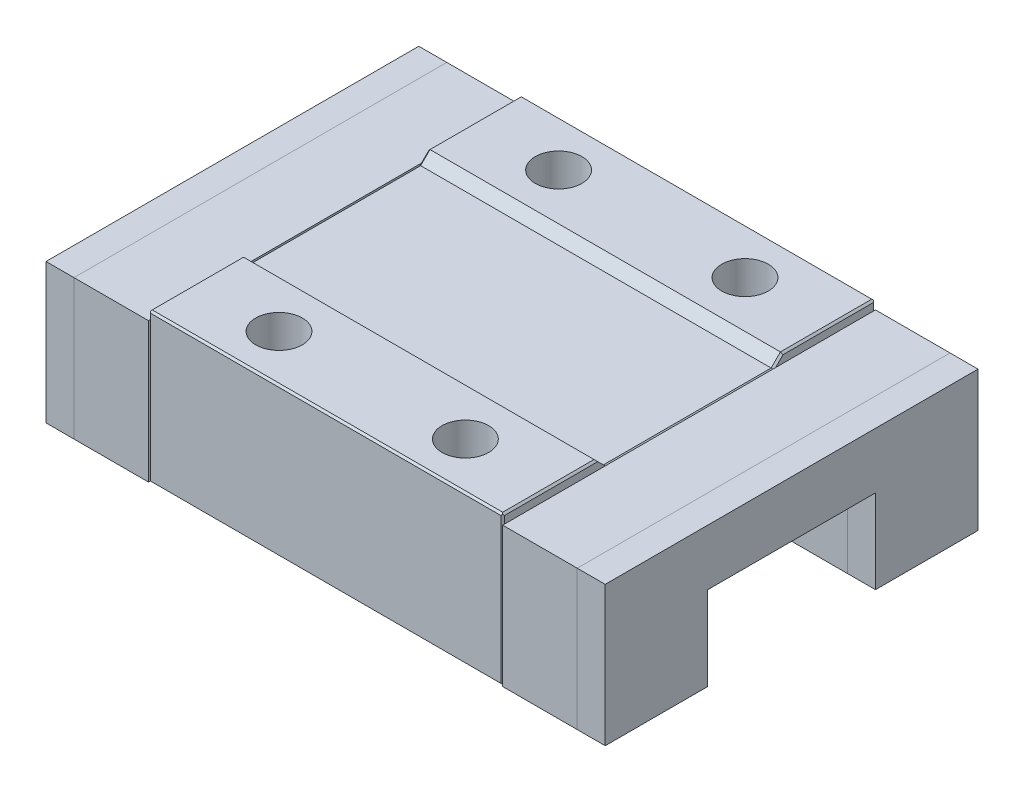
ISO-10303-21;
HEADER;
FILE_DESCRIPTION(('STEP AP214'),'2;1');
FILE_NAME('part.step','',(''),(''),'','','');
FILE_SCHEMA(('AUTOMOTIVE_DESIGN { 1 0 10303 214 1 1 1 1 }'));
ENDSEC;
DATA;
#1=APPLICATION_CONTEXT('core data for automotive mechanical design processes');
#2=APPLICATION_PROTOCOL_DEFINITION('international standard','automotive_design',2000,#1);
#3=PRODUCT_CONTEXT('',#1,'mechanical');
#4=PRODUCT('Part','Part','',(#3));
#5=PRODUCT_RELATED_PRODUCT_CATEGORY('part','',(#4));
#6=PRODUCT_DEFINITION_FORMATION('','',#4);
#7=PRODUCT_DEFINITION_CONTEXT('part definition',#1,'design');
#8=PRODUCT_DEFINITION('design','',#6,#7);
#9=PRODUCT_DEFINITION_SHAPE('','',#8);
#10=(LENGTH_UNIT() NAMED_UNIT(*) SI_UNIT(.MILLI.,.METRE.));
#11=(NAMED_UNIT(*) PLANE_ANGLE_UNIT() SI_UNIT($,.RADIAN.));
#12=(NAMED_UNIT(*) SI_UNIT($,.STERADIAN.) SOLID_ANGLE_UNIT());
#13=UNCERTAINTY_MEASURE_WITH_UNIT(LENGTH_MEASURE(1.E-05),#10,'distance_accuracy_value','');
#14=(GEOMETRIC_REPRESENTATION_CONTEXT(3) GLOBAL_UNCERTAINTY_ASSIGNED_CONTEXT((#13)) GLOBAL_UNIT_ASSIGNED_CONTEXT((#10,
#11,#12)) REPRESENTATION_CONTEXT('',''));
#15=CARTESIAN_POINT('',(0.,0.,0.));
#16=DIRECTION('',(0.,0.,1.));
#17=DIRECTION('',(1.,0.,0.));
#18=AXIS2_PLACEMENT_3D('',#15,#16,#17);
#19=CARTESIAN_POINT('',(-24.5,-4.,4.5));
#20=DIRECTION('',(0.,1.,0.));
#21=DIRECTION('',(0.,0.,1.));
#22=AXIS2_PLACEMENT_3D('',#19,#20,#21);
#23=PLANE('',#22);
#24=DIRECTION('',(0.,0.,1.));
#25=VECTOR('',#24,1.);
#26=CARTESIAN_POINT('',(-23.,-4.,4.5));
#27=LINE('',#26,#25);
#28=CARTESIAN_POINT('',(-23.,-4.,4.5));
#29=VERTEX_POINT('',#28);
#30=CARTESIAN_POINT('',(-23.,-4.,10.));
#31=VERTEX_POINT('',#30);
#32=EDGE_CURVE('E153',#29,#31,#27,.T.);
#33=ORIENTED_EDGE('',*,*,#32,.T.);
#34=DIRECTION('',(1.,0.,0.));
#35=VECTOR('',#34,1.);
#36=CARTESIAN_POINT('',(-24.5,-4.,10.));
#37=LINE('',#36,#35);
#38=CARTESIAN_POINT('',(-24.5,-4.,10.));
#39=VERTEX_POINT('',#38);
#40=EDGE_CURVE('E13',#39,#31,#37,.T.);
#41=ORIENTED_EDGE('',*,*,#40,.F.);
#42=DIRECTION('',(0.,0.,1.));
#43=VECTOR('',#42,1.);
#44=CARTESIAN_POINT('',(-24.5,-4.,4.5));
#45=LINE('',#44,#43);
#46=CARTESIAN_POINT('',(-24.5,-4.,4.5));
#47=VERTEX_POINT('',#46);
#48=EDGE_CURVE('E167',#47,#39,#45,.T.);
#49=ORIENTED_EDGE('',*,*,#48,.F.);
#50=DIRECTION('',(1.,0.,0.));
#51=VECTOR('',#50,1.);
#52=CARTESIAN_POINT('',(-24.5,-4.,4.5));
#53=LINE('',#52,#51);
#54=EDGE_CURVE('E149',#47,#29,#53,.T.);
#55=ORIENTED_EDGE('',*,*,#54,.T.);
#56=EDGE_LOOP('',(#33,#41,#49,#55));
#57=FACE_BOUND('',#56,.T.);
#58=ADVANCED_FACE('F57',(#57),#23,.F.);
#59=CARTESIAN_POINT('',(-24.5,-4.,10.));
#60=DIRECTION('',(0.,0.,-1.));
#61=DIRECTION('',(0.,1.,0.));
#62=AXIS2_PLACEMENT_3D('',#59,#60,#61);
#63=PLANE('',#62);
#64=DIRECTION('',(0.,1.,0.));
#65=VECTOR('',#64,1.);
#66=CARTESIAN_POINT('',(-23.,-4.,10.));
#67=LINE('',#66,#65);
#68=CARTESIAN_POINT('',(-23.,3.5,10.));
#69=VERTEX_POINT('',#68);
#70=EDGE_CURVE('E156',#31,#69,#67,.T.);
#71=ORIENTED_EDGE('',*,*,#70,.T.);
#72=DIRECTION('',(1.,0.,0.));
#73=VECTOR('',#72,1.);
#74=CARTESIAN_POINT('',(-24.5,3.5,10.));
#75=LINE('',#74,#73);
#76=CARTESIAN_POINT('',(-24.5,3.5,10.));
#77=VERTEX_POINT('',#76);
#78=EDGE_CURVE('E65',#77,#69,#75,.T.);
#79=ORIENTED_EDGE('',*,*,#78,.F.);
#80=DIRECTION('',(0.,1.,0.));
#81=VECTOR('',#80,1.);
#82=CARTESIAN_POINT('',(-24.5,-4.,10.));
#83=LINE('',#82,#81);
#84=EDGE_CURVE('E116',#39,#77,#83,.T.);
#85=ORIENTED_EDGE('',*,*,#84,.F.);
#86=ORIENTED_EDGE('',*,*,#40,.T.);
#87=EDGE_LOOP('',(#71,#79,#85,#86));
#88=FACE_BOUND('',#87,.T.);
#89=ADVANCED_FACE('F202',(#88),#63,.F.);
#90=CARTESIAN_POINT('',(-24.5,3.5,10.));
#91=DIRECTION('',(0.,-1.,0.));
#92=DIRECTION('',(0.,0.,-1.));
#93=AXIS2_PLACEMENT_3D('',#90,#91,#92);
#94=PLANE('',#93);
#95=DIRECTION('',(0.,0.,-1.));
#96=VECTOR('',#95,1.);
#97=CARTESIAN_POINT('',(-23.,3.5,10.));
#98=LINE('',#97,#96);
#99=CARTESIAN_POINT('',(-23.,3.5,-10.));
#100=VERTEX_POINT('',#99);
#101=EDGE_CURVE('E158',#69,#100,#98,.T.);
#102=ORIENTED_EDGE('',*,*,#101,.T.);
#103=DIRECTION('',(1.,0.,0.));
#104=VECTOR('',#103,1.);
#105=CARTESIAN_POINT('',(-24.5,3.5,-10.));
#106=LINE('',#105,#104);
#107=CARTESIAN_POINT('',(-24.5,3.5,-10.));
#108=VERTEX_POINT('',#107);
#109=EDGE_CURVE('E174',#108,#100,#106,.T.);
#110=ORIENTED_EDGE('',*,*,#109,.F.);
#111=DIRECTION('',(0.,0.,-1.));
#112=VECTOR('',#111,1.);
#113=CARTESIAN_POINT('',(-24.5,3.5,10.));
#114=LINE('',#113,#112);
#115=EDGE_CURVE('E182',#77,#108,#114,.T.);
#116=ORIENTED_EDGE('',*,*,#115,.F.);
#117=ORIENTED_EDGE('',*,*,#78,.T.);
#118=EDGE_LOOP('',(#102,#110,#116,#117));
#119=FACE_BOUND('',#118,.T.);
#120=ADVANCED_FACE('F180',(#119),#94,.F.);
#121=CARTESIAN_POINT('',(-24.5,3.5,-10.));
#122=DIRECTION('',(0.,0.,1.));
#123=DIRECTION('',(1.,0.,0.));
#124=AXIS2_PLACEMENT_3D('',#121,#122,#123);
#125=PLANE('',#124);
#126=DIRECTION('',(0.,-1.,0.));
#127=VECTOR('',#126,1.);
#128=CARTESIAN_POINT('',(-23.,3.5,-10.));
#129=LINE('',#128,#127);
#130=CARTESIAN_POINT('',(-23.,-4.,-10.));
#131=VERTEX_POINT('',#130);
#132=EDGE_CURVE('E160',#100,#131,#129,.T.);
#133=ORIENTED_EDGE('',*,*,#132,.T.);
#134=DIRECTION('',(1.,0.,0.));
#135=VECTOR('',#134,1.);
#136=CARTESIAN_POINT('',(-24.5,-4.,-10.));
#137=LINE('',#136,#135);
#138=CARTESIAN_POINT('',(-24.5,-4.,-10.));
#139=VERTEX_POINT('',#138);
#140=EDGE_CURVE('E171',#139,#131,#137,.T.);
#141=ORIENTED_EDGE('',*,*,#140,.F.);
#142=DIRECTION('',(0.,-1.,0.));
#143=VECTOR('',#142,1.);
#144=CARTESIAN_POINT('',(-24.5,3.5,-10.));
#145=LINE('',#144,#143);
#146=EDGE_CURVE('E194',#108,#139,#145,.T.);
#147=ORIENTED_EDGE('',*,*,#146,.F.);
#148=ORIENTED_EDGE('',*,*,#109,.T.);
#149=EDGE_LOOP('',(#133,#141,#147,#148));
#150=FACE_BOUND('',#149,.T.);
#151=ADVANCED_FACE('F190',(#150),#125,.F.);
#152=CARTESIAN_POINT('',(-24.5,-4.,-10.));
#153=DIRECTION('',(0.,1.,0.));
#154=DIRECTION('',(0.,0.,1.));
#155=AXIS2_PLACEMENT_3D('',#152,#153,#154);
#156=PLANE('',#155);
#157=DIRECTION('',(0.,0.,1.));
#158=VECTOR('',#157,1.);
#159=CARTESIAN_POINT('',(-23.,-4.,-10.));
#160=LINE('',#159,#158);
#161=CARTESIAN_POINT('',(-23.,-4.,-4.5));
#162=VERTEX_POINT('',#161);
#163=EDGE_CURVE('E162',#131,#162,#160,.T.);
#164=ORIENTED_EDGE('',*,*,#163,.T.);
#165=DIRECTION('',(1.,0.,0.));
#166=VECTOR('',#165,1.);
#167=CARTESIAN_POINT('',(-24.5,-4.,-4.5));
#168=LINE('',#167,#166);
#169=CARTESIAN_POINT('',(-24.5,-4.,-4.5));
#170=VERTEX_POINT('',#169);
#171=EDGE_CURVE('E144',#170,#162,#168,.T.);
#172=ORIENTED_EDGE('',*,*,#171,.F.);
#173=DIRECTION('',(0.,0.,1.));
#174=VECTOR('',#173,1.);
#175=CARTESIAN_POINT('',(-24.5,-4.,-10.));
#176=LINE('',#175,#174);
#177=EDGE_CURVE('E135',#139,#170,#176,.T.);
#178=ORIENTED_EDGE('',*,*,#177,.F.);
#179=ORIENTED_EDGE('',*,*,#140,.T.);
#180=EDGE_LOOP('',(#164,#172,#178,#179));
#181=FACE_BOUND('',#180,.T.);
#182=ADVANCED_FACE('F193',(#181),#156,.F.);
#183=CARTESIAN_POINT('',(-24.5,-4.,-4.5));
#184=DIRECTION('',(0.,0.,-1.));
#185=DIRECTION('',(-1.,0.,0.));
#186=AXIS2_PLACEMENT_3D('',#183,#184,#185);
#187=PLANE('',#186);
#188=DIRECTION('',(0.,1.,0.));
#189=VECTOR('',#188,1.);
#190=CARTESIAN_POINT('',(-23.,-4.,-4.5));
#191=LINE('',#190,#189);
#192=CARTESIAN_POINT('',(-23.,0.499999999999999,-4.5));
#193=VERTEX_POINT('',#192);
#194=EDGE_CURVE('E143',#162,#193,#191,.T.);
#195=ORIENTED_EDGE('',*,*,#194,.T.);
#196=DIRECTION('',(1.,0.,0.));
#197=VECTOR('',#196,1.);
#198=CARTESIAN_POINT('',(-24.5,0.499999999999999,-4.5));
#199=LINE('',#198,#197);
#200=CARTESIAN_POINT('',(-24.5,0.499999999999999,-4.5));
#201=VERTEX_POINT('',#200);
#202=EDGE_CURVE('E140',#201,#193,#199,.T.);
#203=ORIENTED_EDGE('',*,*,#202,.F.);
#204=DIRECTION('',(0.,1.,0.));
#205=VECTOR('',#204,1.);
#206=CARTESIAN_POINT('',(-24.5,-4.,-4.5));
#207=LINE('',#206,#205);
#208=EDGE_CURVE('E129',#170,#201,#207,.T.);
#209=ORIENTED_EDGE('',*,*,#208,.F.);
#210=ORIENTED_EDGE('',*,*,#171,.T.);
#211=EDGE_LOOP('',(#195,#203,#209,#210));
#212=FACE_BOUND('',#211,.T.);
#213=ADVANCED_FACE('F141',(#212),#187,.F.);
#214=CARTESIAN_POINT('',(-24.5,0.499999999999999,-4.5));
#215=DIRECTION('',(0.,1.,0.));
#216=DIRECTION('',(0.,0.,1.));
#217=AXIS2_PLACEMENT_3D('',#214,#215,#216);
#218=PLANE('',#217);
#219=DIRECTION('',(0.,0.,1.));
#220=VECTOR('',#219,1.);
#221=CARTESIAN_POINT('',(-23.,0.499999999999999,-4.5));
#222=LINE('',#221,#220);
#223=CARTESIAN_POINT('',(-23.,0.499999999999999,4.5));
#224=VERTEX_POINT('',#223);
#225=EDGE_CURVE('E102',#193,#224,#222,.T.);
#226=ORIENTED_EDGE('',*,*,#225,.T.);
#227=DIRECTION('',(1.,0.,0.));
#228=VECTOR('',#227,1.);
#229=CARTESIAN_POINT('',(-24.5,0.499999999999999,4.5));
#230=LINE('',#229,#228);
#231=CARTESIAN_POINT('',(-24.5,0.499999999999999,4.5));
#232=VERTEX_POINT('',#231);
#233=EDGE_CURVE('E145',#232,#224,#230,.T.);
#234=ORIENTED_EDGE('',*,*,#233,.F.);
#235=DIRECTION('',(0.,0.,1.));
#236=VECTOR('',#235,1.);
#237=CARTESIAN_POINT('',(-24.5,0.499999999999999,-4.5));
#238=LINE('',#237,#236);
#239=EDGE_CURVE('E133',#201,#232,#238,.T.);
#240=ORIENTED_EDGE('',*,*,#239,.F.);
#241=ORIENTED_EDGE('',*,*,#202,.T.);
#242=EDGE_LOOP('',(#226,#234,#240,#241));
#243=FACE_BOUND('',#242,.T.);
#244=ADVANCED_FACE('F147',(#243),#218,.F.);
#245=CARTESIAN_POINT('',(-24.5,0.499999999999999,4.5));
#246=DIRECTION('',(0.,0.,1.));
#247=DIRECTION('',(1.,0.,0.));
#248=AXIS2_PLACEMENT_3D('',#245,#246,#247);
#249=PLANE('',#248);
#250=DIRECTION('',(0.,-1.,0.));
#251=VECTOR('',#250,1.);
#252=CARTESIAN_POINT('',(-23.,0.499999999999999,4.5));
#253=LINE('',#252,#251);
#254=EDGE_CURVE('E108',#224,#29,#253,.T.);
#255=ORIENTED_EDGE('',*,*,#254,.T.);
#256=ORIENTED_EDGE('',*,*,#54,.F.);
#257=DIRECTION('',(0.,-1.,0.));
#258=VECTOR('',#257,1.);
#259=CARTESIAN_POINT('',(-24.5,0.499999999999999,4.5));
#260=LINE('',#259,#258);
#261=EDGE_CURVE('E73',#232,#47,#260,.T.);
#262=ORIENTED_EDGE('',*,*,#261,.F.);
#263=ORIENTED_EDGE('',*,*,#233,.T.);
#264=EDGE_LOOP('',(#255,#256,#262,#263));
#265=FACE_BOUND('',#264,.T.);
#266=ADVANCED_FACE('F218',(#265),#249,.F.);
#267=CARTESIAN_POINT('',(-24.5,0.,0.));
#268=DIRECTION('',(-1.,0.,0.));
#269=DIRECTION('',(0.,0.,1.));
#270=AXIS2_PLACEMENT_3D('',#267,#268,#269);
#271=PLANE('',#270);
#272=ORIENTED_EDGE('',*,*,#48,.T.);
#273=ORIENTED_EDGE('',*,*,#84,.T.);
#274=ORIENTED_EDGE('',*,*,#115,.T.);
#275=ORIENTED_EDGE('',*,*,#146,.T.);
#276=ORIENTED_EDGE('',*,*,#177,.T.);
#277=ORIENTED_EDGE('',*,*,#208,.T.);
#278=ORIENTED_EDGE('',*,*,#239,.T.);
#279=ORIENTED_EDGE('',*,*,#261,.T.);
#280=EDGE_LOOP('',(#272,#273,#274,#275,#276,#277,#278,#279));
#281=FACE_BOUND('',#280,.T.);
#282=ADVANCED_FACE('F131',(#281),#271,.T.);
#283=CARTESIAN_POINT('',(-23.,0.,0.));
#284=DIRECTION('',(-1.,0.,0.));
#285=DIRECTION('',(0.,0.,1.));
#286=AXIS2_PLACEMENT_3D('',#283,#284,#285);
#287=PLANE('',#286);
#288=ORIENTED_EDGE('',*,*,#32,.F.);
#289=ORIENTED_EDGE('',*,*,#254,.F.);
#290=ORIENTED_EDGE('',*,*,#225,.F.);
#291=ORIENTED_EDGE('',*,*,#194,.F.);
#292=ORIENTED_EDGE('',*,*,#163,.F.);
#293=ORIENTED_EDGE('',*,*,#132,.F.);
#294=ORIENTED_EDGE('',*,*,#101,.F.);
#295=ORIENTED_EDGE('',*,*,#70,.F.);
#296=EDGE_LOOP('',(#288,#289,#290,#291,#292,#293,#294,#295));
#297=FACE_BOUND('',#296,.T.);
#298=ADVANCED_FACE('F186',(#297),#287,.F.);
#299=CLOSED_SHELL('',(#58,#89,#120,#151,#182,#213,#244,#266,#282,#298));
#300=MANIFOLD_SOLID_BREP('B2',#299);
#301=CARTESIAN_POINT('',(5.5,3.5,-9.99999999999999));
#302=DIRECTION('',(0.,-1.,0.));
#303=DIRECTION('',(0.,0.,-1.));
#304=AXIS2_PLACEMENT_3D('',#301,#302,#303);
#305=PLANE('',#304);
#306=DIRECTION('',(0.,0.,1.));
#307=VECTOR('',#306,1.);
#308=CARTESIAN_POINT('',(4.,3.5,-9.99999999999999));
#309=LINE('',#308,#307);
#310=CARTESIAN_POINT('',(4.,3.5,-9.99999999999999));
#311=VERTEX_POINT('',#310);
#312=CARTESIAN_POINT('',(4.,3.5,10.));
#313=VERTEX_POINT('',#312);
#314=EDGE_CURVE('E411',#311,#313,#309,.T.);
#315=ORIENTED_EDGE('',*,*,#314,.T.);
#316=DIRECTION('',(-1.,0.,0.));
#317=VECTOR('',#316,1.);
#318=CARTESIAN_POINT('',(5.5,3.5,10.));
#319=LINE('',#318,#317);
#320=CARTESIAN_POINT('',(5.5,3.5,10.));
#321=VERTEX_POINT('',#320);
#322=EDGE_CURVE('E55',#321,#313,#319,.T.);
#323=ORIENTED_EDGE('',*,*,#322,.F.);
#324=DIRECTION('',(0.,0.,1.));
#325=VECTOR('',#324,1.);
#326=CARTESIAN_POINT('',(5.5,3.5,-9.99999999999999));
#327=LINE('',#326,#325);
#328=CARTESIAN_POINT('',(5.5,3.5,-9.99999999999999));
#329=VERTEX_POINT('',#328);
#330=EDGE_CURVE('E425',#329,#321,#327,.T.);
#331=ORIENTED_EDGE('',*,*,#330,.F.);
#332=DIRECTION('',(-1.,0.,0.));
#333=VECTOR('',#332,1.);
#334=CARTESIAN_POINT('',(5.5,3.5,-9.99999999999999));
#335=LINE('',#334,#333);
#336=EDGE_CURVE('E407',#329,#311,#335,.T.);
#337=ORIENTED_EDGE('',*,*,#336,.T.);
#338=EDGE_LOOP('',(#315,#323,#331,#337));
#339=FACE_BOUND('',#338,.T.);
#340=ADVANCED_FACE('F315',(#339),#305,.F.);
#341=CARTESIAN_POINT('',(5.5,3.5,10.));
#342=DIRECTION('',(0.,0.,-1.));
#343=DIRECTION('',(0.,1.,0.));
#344=AXIS2_PLACEMENT_3D('',#341,#342,#343);
#345=PLANE('',#344);
#346=DIRECTION('',(0.,-1.,0.));
#347=VECTOR('',#346,1.);
#348=CARTESIAN_POINT('',(4.,3.5,10.));
#349=LINE('',#348,#347);
#350=CARTESIAN_POINT('',(4.,-4.,10.));
#351=VERTEX_POINT('',#350);
#352=EDGE_CURVE('E414',#313,#351,#349,.T.);
#353=ORIENTED_EDGE('',*,*,#352,.T.);
#354=DIRECTION('',(-1.,0.,0.));
#355=VECTOR('',#354,1.);
#356=CARTESIAN_POINT('',(5.5,-4.,10.));
#357=LINE('',#356,#355);
#358=CARTESIAN_POINT('',(5.5,-4.,10.));
#359=VERTEX_POINT('',#358);
#360=EDGE_CURVE('E323',#359,#351,#357,.T.);
#361=ORIENTED_EDGE('',*,*,#360,.F.);
#362=DIRECTION('',(0.,-1.,0.));
#363=VECTOR('',#362,1.);
#364=CARTESIAN_POINT('',(5.5,3.5,10.));
#365=LINE('',#364,#363);
#366=EDGE_CURVE('E374',#321,#359,#365,.T.);
#367=ORIENTED_EDGE('',*,*,#366,.F.);
#368=ORIENTED_EDGE('',*,*,#322,.T.);
#369=EDGE_LOOP('',(#353,#361,#367,#368));
#370=FACE_BOUND('',#369,.T.);
#371=ADVANCED_FACE('F460',(#370),#345,.F.);
#372=CARTESIAN_POINT('',(5.5,-4.,10.));
#373=DIRECTION('',(0.,1.,0.));
#374=DIRECTION('',(0.,0.,1.));
#375=AXIS2_PLACEMENT_3D('',#372,#373,#374);
#376=PLANE('',#375);
#377=DIRECTION('',(0.,0.,-1.));
#378=VECTOR('',#377,1.);
#379=CARTESIAN_POINT('',(4.,-4.,10.));
#380=LINE('',#379,#378);
#381=CARTESIAN_POINT('',(4.,-4.,4.5));
#382=VERTEX_POINT('',#381);
#383=EDGE_CURVE('E416',#351,#382,#380,.T.);
#384=ORIENTED_EDGE('',*,*,#383,.T.);
#385=DIRECTION('',(-1.,0.,0.));
#386=VECTOR('',#385,1.);
#387=CARTESIAN_POINT('',(5.5,-4.,4.5));
#388=LINE('',#387,#386);
#389=CARTESIAN_POINT('',(5.5,-4.,4.5));
#390=VERTEX_POINT('',#389);
#391=EDGE_CURVE('E432',#390,#382,#388,.T.);
#392=ORIENTED_EDGE('',*,*,#391,.F.);
#393=DIRECTION('',(0.,0.,-1.));
#394=VECTOR('',#393,1.);
#395=CARTESIAN_POINT('',(5.5,-4.,10.));
#396=LINE('',#395,#394);
#397=EDGE_CURVE('E440',#359,#390,#396,.T.);
#398=ORIENTED_EDGE('',*,*,#397,.F.);
#399=ORIENTED_EDGE('',*,*,#360,.T.);
#400=EDGE_LOOP('',(#384,#392,#398,#399));
#401=FACE_BOUND('',#400,.T.);
#402=ADVANCED_FACE('F438',(#401),#376,.F.);
#403=CARTESIAN_POINT('',(5.5,-4.,4.5));
#404=DIRECTION('',(0.,0.,1.));
#405=DIRECTION('',(1.,0.,0.));
#406=AXIS2_PLACEMENT_3D('',#403,#404,#405);
#407=PLANE('',#406);
#408=DIRECTION('',(0.,1.,0.));
#409=VECTOR('',#408,1.);
#410=CARTESIAN_POINT('',(4.,-4.,4.5));
#411=LINE('',#410,#409);
#412=CARTESIAN_POINT('',(4.,0.499999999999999,4.5));
#413=VERTEX_POINT('',#412);
#414=EDGE_CURVE('E418',#382,#413,#411,.T.);
#415=ORIENTED_EDGE('',*,*,#414,.T.);
#416=DIRECTION('',(-1.,0.,0.));
#417=VECTOR('',#416,1.);
#418=CARTESIAN_POINT('',(5.5,0.499999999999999,4.5));
#419=LINE('',#418,#417);
#420=CARTESIAN_POINT('',(5.5,0.499999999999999,4.5));
#421=VERTEX_POINT('',#420);
#422=EDGE_CURVE('E429',#421,#413,#419,.T.);
#423=ORIENTED_EDGE('',*,*,#422,.F.);
#424=DIRECTION('',(0.,1.,0.));
#425=VECTOR('',#424,1.);
#426=CARTESIAN_POINT('',(5.5,-4.,4.5));
#427=LINE('',#426,#425);
#428=EDGE_CURVE('E452',#390,#421,#427,.T.);
#429=ORIENTED_EDGE('',*,*,#428,.F.);
#430=ORIENTED_EDGE('',*,*,#391,.T.);
#431=EDGE_LOOP('',(#415,#423,#429,#430));
#432=FACE_BOUND('',#431,.T.);
#433=ADVANCED_FACE('F448',(#432),#407,.F.);
#434=CARTESIAN_POINT('',(5.5,0.499999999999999,4.5));
#435=DIRECTION('',(0.,1.,0.));
#436=DIRECTION('',(0.,0.,1.));
#437=AXIS2_PLACEMENT_3D('',#434,#435,#436);
#438=PLANE('',#437);
#439=DIRECTION('',(0.,0.,-1.));
#440=VECTOR('',#439,1.);
#441=CARTESIAN_POINT('',(4.,0.499999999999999,4.5));
#442=LINE('',#441,#440);
#443=CARTESIAN_POINT('',(4.,0.499999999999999,-4.5));
#444=VERTEX_POINT('',#443);
#445=EDGE_CURVE('E420',#413,#444,#442,.T.);
#446=ORIENTED_EDGE('',*,*,#445,.T.);
#447=DIRECTION('',(-1.,0.,0.));
#448=VECTOR('',#447,1.);
#449=CARTESIAN_POINT('',(5.5,0.499999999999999,-4.5));
#450=LINE('',#449,#448);
#451=CARTESIAN_POINT('',(5.5,0.499999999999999,-4.5));
#452=VERTEX_POINT('',#451);
#453=EDGE_CURVE('E402',#452,#444,#450,.T.);
#454=ORIENTED_EDGE('',*,*,#453,.F.);
#455=DIRECTION('',(0.,0.,-1.));
#456=VECTOR('',#455,1.);
#457=CARTESIAN_POINT('',(5.5,0.499999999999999,4.5));
#458=LINE('',#457,#456);
#459=EDGE_CURVE('E393',#421,#452,#458,.T.);
#460=ORIENTED_EDGE('',*,*,#459,.F.);
#461=ORIENTED_EDGE('',*,*,#422,.T.);
#462=EDGE_LOOP('',(#446,#454,#460,#461));
#463=FACE_BOUND('',#462,.T.);
#464=ADVANCED_FACE('F451',(#463),#438,.F.);
#465=CARTESIAN_POINT('',(5.5,0.499999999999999,-4.5));
#466=DIRECTION('',(0.,0.,-1.));
#467=DIRECTION('',(-1.,0.,0.));
#468=AXIS2_PLACEMENT_3D('',#465,#466,#467);
#469=PLANE('',#468);
#470=DIRECTION('',(0.,-1.,0.));
#471=VECTOR('',#470,1.);
#472=CARTESIAN_POINT('',(4.,0.499999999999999,-4.5));
#473=LINE('',#472,#471);
#474=CARTESIAN_POINT('',(4.,-4.,-4.5));
#475=VERTEX_POINT('',#474);
#476=EDGE_CURVE('E401',#444,#475,#473,.T.);
#477=ORIENTED_EDGE('',*,*,#476,.T.);
#478=DIRECTION('',(-1.,0.,0.));
#479=VECTOR('',#478,1.);
#480=CARTESIAN_POINT('',(5.5,-4.,-4.5));
#481=LINE('',#480,#479);
#482=CARTESIAN_POINT('',(5.5,-4.,-4.5));
#483=VERTEX_POINT('',#482);
#484=EDGE_CURVE('E398',#483,#475,#481,.T.);
#485=ORIENTED_EDGE('',*,*,#484,.F.);
#486=DIRECTION('',(0.,-1.,0.));
#487=VECTOR('',#486,1.);
#488=CARTESIAN_POINT('',(5.5,0.499999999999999,-4.5));
#489=LINE('',#488,#487);
#490=EDGE_CURVE('E387',#452,#483,#489,.T.);
#491=ORIENTED_EDGE('',*,*,#490,.F.);
#492=ORIENTED_EDGE('',*,*,#453,.T.);
#493=EDGE_LOOP('',(#477,#485,#491,#492));
#494=FACE_BOUND('',#493,.T.);
#495=ADVANCED_FACE('F399',(#494),#469,.F.);
#496=CARTESIAN_POINT('',(5.5,-4.,-4.5));
#497=DIRECTION('',(0.,1.,0.));
#498=DIRECTION('',(0.,0.,1.));
#499=AXIS2_PLACEMENT_3D('',#496,#497,#498);
#500=PLANE('',#499);
#501=DIRECTION('',(0.,0.,-1.));
#502=VECTOR('',#501,1.);
#503=CARTESIAN_POINT('',(4.,-4.,-4.5));
#504=LINE('',#503,#502);
#505=CARTESIAN_POINT('',(4.,-4.,-10.));
#506=VERTEX_POINT('',#505);
#507=EDGE_CURVE('E360',#475,#506,#504,.T.);
#508=ORIENTED_EDGE('',*,*,#507,.T.);
#509=DIRECTION('',(-1.,0.,0.));
#510=VECTOR('',#509,1.);
#511=CARTESIAN_POINT('',(5.5,-4.,-10.));
#512=LINE('',#511,#510);
#513=CARTESIAN_POINT('',(5.5,-4.,-10.));
#514=VERTEX_POINT('',#513);
#515=EDGE_CURVE('E403',#514,#506,#512,.T.);
#516=ORIENTED_EDGE('',*,*,#515,.F.);
#517=DIRECTION('',(0.,0.,-1.));
#518=VECTOR('',#517,1.);
#519=CARTESIAN_POINT('',(5.5,-4.,-4.5));
#520=LINE('',#519,#518);
#521=EDGE_CURVE('E391',#483,#514,#520,.T.);
#522=ORIENTED_EDGE('',*,*,#521,.F.);
#523=ORIENTED_EDGE('',*,*,#484,.T.);
#524=EDGE_LOOP('',(#508,#516,#522,#523));
#525=FACE_BOUND('',#524,.T.);
#526=ADVANCED_FACE('F405',(#525),#500,.F.);
#527=CARTESIAN_POINT('',(5.5,-4.,-10.));
#528=DIRECTION('',(0.,0.,1.));
#529=DIRECTION('',(0.,-1.,0.));
#530=AXIS2_PLACEMENT_3D('',#527,#528,#529);
#531=PLANE('',#530);
#532=DIRECTION('',(0.,1.,0.));
#533=VECTOR('',#532,1.);
#534=CARTESIAN_POINT('',(4.,-4.,-10.));
#535=LINE('',#534,#533);
#536=EDGE_CURVE('E366',#506,#311,#535,.T.);
#537=ORIENTED_EDGE('',*,*,#536,.T.);
#538=ORIENTED_EDGE('',*,*,#336,.F.);
#539=DIRECTION('',(0.,1.,0.));
#540=VECTOR('',#539,1.);
#541=CARTESIAN_POINT('',(5.5,-4.,-10.));
#542=LINE('',#541,#540);
#543=EDGE_CURVE('E331',#514,#329,#542,.T.);
#544=ORIENTED_EDGE('',*,*,#543,.F.);
#545=ORIENTED_EDGE('',*,*,#515,.T.);
#546=EDGE_LOOP('',(#537,#538,#544,#545));
#547=FACE_BOUND('',#546,.T.);
#548=ADVANCED_FACE('F476',(#547),#531,.F.);
#549=CARTESIAN_POINT('',(5.5,0.,0.));
#550=DIRECTION('',(1.,0.,0.));
#551=DIRECTION('',(0.,0.,-1.));
#552=AXIS2_PLACEMENT_3D('',#549,#550,#551);
#553=PLANE('',#552);
#554=ORIENTED_EDGE('',*,*,#330,.T.);
#555=ORIENTED_EDGE('',*,*,#366,.T.);
#556=ORIENTED_EDGE('',*,*,#397,.T.);
#557=ORIENTED_EDGE('',*,*,#428,.T.);
#558=ORIENTED_EDGE('',*,*,#459,.T.);
#559=ORIENTED_EDGE('',*,*,#490,.T.);
#560=ORIENTED_EDGE('',*,*,#521,.T.);
#561=ORIENTED_EDGE('',*,*,#543,.T.);
#562=EDGE_LOOP('',(#554,#555,#556,#557,#558,#559,#560,#561));
#563=FACE_BOUND('',#562,.T.);
#564=ADVANCED_FACE('F389',(#563),#553,.T.);
#565=CARTESIAN_POINT('',(4.,0.,0.));
#566=DIRECTION('',(1.,0.,0.));
#567=DIRECTION('',(0.,0.,-1.));
#568=AXIS2_PLACEMENT_3D('',#565,#566,#567);
#569=PLANE('',#568);
#570=ORIENTED_EDGE('',*,*,#314,.F.);
#571=ORIENTED_EDGE('',*,*,#536,.F.);
#572=ORIENTED_EDGE('',*,*,#507,.F.);
#573=ORIENTED_EDGE('',*,*,#476,.F.);
#574=ORIENTED_EDGE('',*,*,#445,.F.);
#575=ORIENTED_EDGE('',*,*,#414,.F.);
#576=ORIENTED_EDGE('',*,*,#383,.F.);
#577=ORIENTED_EDGE('',*,*,#352,.F.);
#578=EDGE_LOOP('',(#570,#571,#572,#573,#574,#575,#576,#577));
#579=FACE_BOUND('',#578,.T.);
#580=ADVANCED_FACE('F444',(#579),#569,.F.);
#581=CLOSED_SHELL('',(#340,#371,#402,#433,#464,#495,#526,#548,#564,#580));
#582=MANIFOLD_SOLID_BREP('B7',#581);
#583=CARTESIAN_POINT('',(-23.,0.,10.));
#584=DIRECTION('',(0.,0.,-1.));
#585=DIRECTION('',(0.,1.,0.));
#586=AXIS2_PLACEMENT_3D('',#583,#584,#585);
#587=PLANE('',#586);
#588=DIRECTION('',(0.,1.,0.));
#589=VECTOR('',#588,1.);
#590=CARTESIAN_POINT('',(-19.,0.,10.));
#591=LINE('',#590,#589);
#592=CARTESIAN_POINT('',(-19.,-4.,10.));
#593=VERTEX_POINT('',#592);
#594=CARTESIAN_POINT('',(-19.,3.5,10.));
#595=VERTEX_POINT('',#594);
#596=EDGE_CURVE('E669',#593,#595,#591,.T.);
#597=ORIENTED_EDGE('',*,*,#596,.T.);
#598=DIRECTION('',(1.,0.,0.));
#599=VECTOR('',#598,1.);
#600=CARTESIAN_POINT('',(-23.,3.5,10.));
#601=LINE('',#600,#599);
#602=CARTESIAN_POINT('',(-23.,3.5,10.));
#603=VERTEX_POINT('',#602);
#604=EDGE_CURVE('E313',#603,#595,#601,.T.);
#605=ORIENTED_EDGE('',*,*,#604,.F.);
#606=DIRECTION('',(0.,1.,0.));
#607=VECTOR('',#606,1.);
#608=CARTESIAN_POINT('',(-23.,0.,10.));
#609=LINE('',#608,#607);
#610=CARTESIAN_POINT('',(-23.,-4.,10.));
#611=VERTEX_POINT('',#610);
#612=EDGE_CURVE('E683',#611,#603,#609,.T.);
#613=ORIENTED_EDGE('',*,*,#612,.F.);
#614=DIRECTION('',(1.,0.,0.));
#615=VECTOR('',#614,1.);
#616=CARTESIAN_POINT('',(-23.,-4.,10.));
#617=LINE('',#616,#615);
#618=EDGE_CURVE('E665',#611,#593,#617,.T.);
#619=ORIENTED_EDGE('',*,*,#618,.T.);
#620=EDGE_LOOP('',(#597,#605,#613,#619));
#621=FACE_BOUND('',#620,.T.);
#622=ADVANCED_FACE('F573',(#621),#587,.F.);
#623=CARTESIAN_POINT('',(-23.,3.5,0.));
#624=DIRECTION('',(0.,-1.,0.));
#625=DIRECTION('',(0.,0.,-1.));
#626=AXIS2_PLACEMENT_3D('',#623,#624,#625);
#627=PLANE('',#626);
#628=DIRECTION('',(0.,0.,-1.));
#629=VECTOR('',#628,1.);
#630=CARTESIAN_POINT('',(-19.,3.5,0.));
#631=LINE('',#630,#629);
#632=CARTESIAN_POINT('',(-19.,3.5,-10.));
#633=VERTEX_POINT('',#632);
#634=EDGE_CURVE('E672',#595,#633,#631,.T.);
#635=ORIENTED_EDGE('',*,*,#634,.T.);
#636=DIRECTION('',(1.,0.,0.));
#637=VECTOR('',#636,1.);
#638=CARTESIAN_POINT('',(-23.,3.5,-10.));
#639=LINE('',#638,#637);
#640=CARTESIAN_POINT('',(-23.,3.5,-10.));
#641=VERTEX_POINT('',#640);
#642=EDGE_CURVE('E581',#641,#633,#639,.T.);
#643=ORIENTED_EDGE('',*,*,#642,.F.);
#644=DIRECTION('',(0.,0.,-1.));
#645=VECTOR('',#644,1.);
#646=CARTESIAN_POINT('',(-23.,3.5,0.));
#647=LINE('',#646,#645);
#648=EDGE_CURVE('E632',#603,#641,#647,.T.);
#649=ORIENTED_EDGE('',*,*,#648,.F.);
#650=ORIENTED_EDGE('',*,*,#604,.T.);
#651=EDGE_LOOP('',(#635,#643,#649,#650));
#652=FACE_BOUND('',#651,.T.);
#653=ADVANCED_FACE('F718',(#652),#627,.F.);
#654=CARTESIAN_POINT('',(-23.,0.,-10.));
#655=DIRECTION('',(0.,0.,1.));
#656=DIRECTION('',(0.,-1.,0.));
#657=AXIS2_PLACEMENT_3D('',#654,#655,#656);
#658=PLANE('',#657);
#659=DIRECTION('',(0.,-1.,0.));
#660=VECTOR('',#659,1.);
#661=CARTESIAN_POINT('',(-19.,0.,-10.));
#662=LINE('',#661,#660);
#663=CARTESIAN_POINT('',(-19.,-4.,-10.));
#664=VERTEX_POINT('',#663);
#665=EDGE_CURVE('E674',#633,#664,#662,.T.);
#666=ORIENTED_EDGE('',*,*,#665,.T.);
#667=DIRECTION('',(1.,0.,0.));
#668=VECTOR('',#667,1.);
#669=CARTESIAN_POINT('',(-23.,-4.,-10.));
#670=LINE('',#669,#668);
#671=CARTESIAN_POINT('',(-23.,-4.,-10.));
#672=VERTEX_POINT('',#671);
#673=EDGE_CURVE('E690',#672,#664,#670,.T.);
#674=ORIENTED_EDGE('',*,*,#673,.F.);
#675=DIRECTION('',(0.,-1.,0.));
#676=VECTOR('',#675,1.);
#677=CARTESIAN_POINT('',(-23.,0.,-10.));
#678=LINE('',#677,#676);
#679=EDGE_CURVE('E698',#641,#672,#678,.T.);
#680=ORIENTED_EDGE('',*,*,#679,.F.);
#681=ORIENTED_EDGE('',*,*,#642,.T.);
#682=EDGE_LOOP('',(#666,#674,#680,#681));
#683=FACE_BOUND('',#682,.T.);
#684=ADVANCED_FACE('F696',(#683),#658,.F.);
#685=CARTESIAN_POINT('',(-23.,-4.,0.));
#686=DIRECTION('',(0.,1.,0.));
#687=DIRECTION('',(0.,0.,1.));
#688=AXIS2_PLACEMENT_3D('',#685,#686,#687);
#689=PLANE('',#688);
#690=DIRECTION('',(0.,0.,1.));
#691=VECTOR('',#690,1.);
#692=CARTESIAN_POINT('',(-19.,-4.,0.));
#693=LINE('',#692,#691);
#694=CARTESIAN_POINT('',(-19.,-4.,-4.5));
#695=VERTEX_POINT('',#694);
#696=EDGE_CURVE('E676',#664,#695,#693,.T.);
#697=ORIENTED_EDGE('',*,*,#696,.T.);
#698=DIRECTION('',(1.,0.,0.));
#699=VECTOR('',#698,1.);
#700=CARTESIAN_POINT('',(-23.,-4.,-4.5));
#701=LINE('',#700,#699);
#702=CARTESIAN_POINT('',(-23.,-4.,-4.5));
#703=VERTEX_POINT('',#702);
#704=EDGE_CURVE('E687',#703,#695,#701,.T.);
#705=ORIENTED_EDGE('',*,*,#704,.F.);
#706=DIRECTION('',(0.,0.,1.));
#707=VECTOR('',#706,1.);
#708=CARTESIAN_POINT('',(-23.,-4.,0.));
#709=LINE('',#708,#707);
#710=EDGE_CURVE('E710',#672,#703,#709,.T.);
#711=ORIENTED_EDGE('',*,*,#710,.F.);
#712=ORIENTED_EDGE('',*,*,#673,.T.);
#713=EDGE_LOOP('',(#697,#705,#711,#712));
#714=FACE_BOUND('',#713,.T.);
#715=ADVANCED_FACE('F706',(#714),#689,.F.);
#716=CARTESIAN_POINT('',(-23.,0.,-4.5));
#717=DIRECTION('',(0.,0.,-1.));
#718=DIRECTION('',(-1.,0.,0.));
#719=AXIS2_PLACEMENT_3D('',#716,#717,#718);
#720=PLANE('',#719);
#721=DIRECTION('',(0.,1.,0.));
#722=VECTOR('',#721,1.);
#723=CARTESIAN_POINT('',(-19.,0.,-4.5));
#724=LINE('',#723,#722);
#725=CARTESIAN_POINT('',(-19.,0.499999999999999,-4.5));
#726=VERTEX_POINT('',#725);
#727=EDGE_CURVE('E678',#695,#726,#724,.T.);
#728=ORIENTED_EDGE('',*,*,#727,.T.);
#729=DIRECTION('',(1.,0.,0.));
#730=VECTOR('',#729,1.);
#731=CARTESIAN_POINT('',(-23.,0.499999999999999,-4.5));
#732=LINE('',#731,#730);
#733=CARTESIAN_POINT('',(-23.,0.499999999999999,-4.5));
#734=VERTEX_POINT('',#733);
#735=EDGE_CURVE('E660',#734,#726,#732,.T.);
#736=ORIENTED_EDGE('',*,*,#735,.F.);
#737=DIRECTION('',(0.,1.,0.));
#738=VECTOR('',#737,1.);
#739=CARTESIAN_POINT('',(-23.,0.,-4.5));
#740=LINE('',#739,#738);
#741=EDGE_CURVE('E651',#703,#734,#740,.T.);
#742=ORIENTED_EDGE('',*,*,#741,.F.);
#743=ORIENTED_EDGE('',*,*,#704,.T.);
#744=EDGE_LOOP('',(#728,#736,#742,#743));
#745=FACE_BOUND('',#744,.T.);
#746=ADVANCED_FACE('F709',(#745),#720,.F.);
#747=CARTESIAN_POINT('',(-23.,0.499999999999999,0.));
#748=DIRECTION('',(0.,1.,0.));
#749=DIRECTION('',(0.,0.,1.));
#750=AXIS2_PLACEMENT_3D('',#747,#748,#749);
#751=PLANE('',#750);
#752=DIRECTION('',(0.,0.,1.));
#753=VECTOR('',#752,1.);
#754=CARTESIAN_POINT('',(-19.,0.499999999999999,0.));
#755=LINE('',#754,#753);
#756=CARTESIAN_POINT('',(-19.,0.499999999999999,4.5));
#757=VERTEX_POINT('',#756);
#758=EDGE_CURVE('E659',#726,#757,#755,.T.);
#759=ORIENTED_EDGE('',*,*,#758,.T.);
#760=DIRECTION('',(1.,0.,0.));
#761=VECTOR('',#760,1.);
#762=CARTESIAN_POINT('',(-23.,0.499999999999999,4.5));
#763=LINE('',#762,#761);
#764=CARTESIAN_POINT('',(-23.,0.499999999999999,4.5));
#765=VERTEX_POINT('',#764);
#766=EDGE_CURVE('E656',#765,#757,#763,.T.);
#767=ORIENTED_EDGE('',*,*,#766,.F.);
#768=DIRECTION('',(0.,0.,1.));
#769=VECTOR('',#768,1.);
#770=CARTESIAN_POINT('',(-23.,0.499999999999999,0.));
#771=LINE('',#770,#769);
#772=EDGE_CURVE('E645',#734,#765,#771,.T.);
#773=ORIENTED_EDGE('',*,*,#772,.F.);
#774=ORIENTED_EDGE('',*,*,#735,.T.);
#775=EDGE_LOOP('',(#759,#767,#773,#774));
#776=FACE_BOUND('',#775,.T.);
#777=ADVANCED_FACE('F657',(#776),#751,.F.);
#778=CARTESIAN_POINT('',(-23.,0.,4.5));
#779=DIRECTION('',(0.,0.,1.));
#780=DIRECTION('',(1.,0.,0.));
#781=AXIS2_PLACEMENT_3D('',#778,#779,#780);
#782=PLANE('',#781);
#783=DIRECTION('',(0.,-1.,0.));
#784=VECTOR('',#783,1.);
#785=CARTESIAN_POINT('',(-19.,0.,4.5));
#786=LINE('',#785,#784);
#787=CARTESIAN_POINT('',(-19.,-4.,4.5));
#788=VERTEX_POINT('',#787);
#789=EDGE_CURVE('E618',#757,#788,#786,.T.);
#790=ORIENTED_EDGE('',*,*,#789,.T.);
#791=DIRECTION('',(1.,0.,0.));
#792=VECTOR('',#791,1.);
#793=CARTESIAN_POINT('',(-23.,-4.,4.5));
#794=LINE('',#793,#792);
#795=CARTESIAN_POINT('',(-23.,-4.,4.5));
#796=VERTEX_POINT('',#795);
#797=EDGE_CURVE('E661',#796,#788,#794,.T.);
#798=ORIENTED_EDGE('',*,*,#797,.F.);
#799=DIRECTION('',(0.,-1.,0.));
#800=VECTOR('',#799,1.);
#801=CARTESIAN_POINT('',(-23.,0.,4.5));
#802=LINE('',#801,#800);
#803=EDGE_CURVE('E649',#765,#796,#802,.T.);
#804=ORIENTED_EDGE('',*,*,#803,.F.);
#805=ORIENTED_EDGE('',*,*,#766,.T.);
#806=EDGE_LOOP('',(#790,#798,#804,#805));
#807=FACE_BOUND('',#806,.T.);
#808=ADVANCED_FACE('F663',(#807),#782,.F.);
#809=CARTESIAN_POINT('',(-23.,-4.,0.));
#810=DIRECTION('',(0.,1.,0.));
#811=DIRECTION('',(0.,0.,1.));
#812=AXIS2_PLACEMENT_3D('',#809,#810,#811);
#813=PLANE('',#812);
#814=DIRECTION('',(0.,0.,1.));
#815=VECTOR('',#814,1.);
#816=CARTESIAN_POINT('',(-19.,-4.,0.));
#817=LINE('',#816,#815);
#818=EDGE_CURVE('E624',#788,#593,#817,.T.);
#819=ORIENTED_EDGE('',*,*,#818,.T.);
#820=ORIENTED_EDGE('',*,*,#618,.F.);
#821=DIRECTION('',(0.,0.,1.));
#822=VECTOR('',#821,1.);
#823=CARTESIAN_POINT('',(-23.,-4.,0.));
#824=LINE('',#823,#822);
#825=EDGE_CURVE('E589',#796,#611,#824,.T.);
#826=ORIENTED_EDGE('',*,*,#825,.F.);
#827=ORIENTED_EDGE('',*,*,#797,.T.);
#828=EDGE_LOOP('',(#819,#820,#826,#827));
#829=FACE_BOUND('',#828,.T.);
#830=ADVANCED_FACE('F734',(#829),#813,.F.);
#831=CARTESIAN_POINT('',(-23.,0.,0.));
#832=DIRECTION('',(-1.,0.,0.));
#833=DIRECTION('',(0.,0.,1.));
#834=AXIS2_PLACEMENT_3D('',#831,#832,#833);
#835=PLANE('',#834);
#836=ORIENTED_EDGE('',*,*,#612,.T.);
#837=ORIENTED_EDGE('',*,*,#648,.T.);
#838=ORIENTED_EDGE('',*,*,#679,.T.);
#839=ORIENTED_EDGE('',*,*,#710,.T.);
#840=ORIENTED_EDGE('',*,*,#741,.T.);
#841=ORIENTED_EDGE('',*,*,#772,.T.);
#842=ORIENTED_EDGE('',*,*,#803,.T.);
#843=ORIENTED_EDGE('',*,*,#825,.T.);
#844=EDGE_LOOP('',(#836,#837,#838,#839,#840,#841,#842,#843));
#845=FACE_BOUND('',#844,.T.);
#846=ADVANCED_FACE('F647',(#845),#835,.T.);
#847=CARTESIAN_POINT('',(-19.,0.,0.));
#848=DIRECTION('',(-1.,0.,0.));
#849=DIRECTION('',(0.,0.,1.));
#850=AXIS2_PLACEMENT_3D('',#847,#848,#849);
#851=PLANE('',#850);
#852=ORIENTED_EDGE('',*,*,#596,.F.);
#853=ORIENTED_EDGE('',*,*,#818,.F.);
#854=ORIENTED_EDGE('',*,*,#789,.F.);
#855=ORIENTED_EDGE('',*,*,#758,.F.);
#856=ORIENTED_EDGE('',*,*,#727,.F.);
#857=ORIENTED_EDGE('',*,*,#696,.F.);
#858=ORIENTED_EDGE('',*,*,#665,.F.);
#859=ORIENTED_EDGE('',*,*,#634,.F.);
#860=EDGE_LOOP('',(#852,#853,#854,#855,#856,#857,#858,#859));
#861=FACE_BOUND('',#860,.T.);
#862=ADVANCED_FACE('F702',(#861),#851,.F.);
#863=CLOSED_SHELL('',(#622,#653,#684,#715,#746,#777,#808,#830,#846,#862));
#864=MANIFOLD_SOLID_BREP('B49',#863);
#865=CARTESIAN_POINT('',(4.,3.5,10.));
#866=DIRECTION('',(0.,0.,-1.));
#867=DIRECTION('',(0.,1.,0.));
#868=AXIS2_PLACEMENT_3D('',#865,#866,#867);
#869=PLANE('',#868);
#870=DIRECTION('',(0.,-1.,0.));
#871=VECTOR('',#870,1.);
#872=CARTESIAN_POINT('',(0.,3.5,10.));
#873=LINE('',#872,#871);
#874=CARTESIAN_POINT('',(0.,3.5,10.));
#875=VERTEX_POINT('',#874);
#876=CARTESIAN_POINT('',(0.,-4.,10.));
#877=VERTEX_POINT('',#876);
#878=EDGE_CURVE('E974',#875,#877,#873,.T.);
#879=ORIENTED_EDGE('',*,*,#878,.T.);
#880=DIRECTION('',(-1.,0.,0.));
#881=VECTOR('',#880,1.);
#882=CARTESIAN_POINT('',(4.,-4.,10.));
#883=LINE('',#882,#881);
#884=CARTESIAN_POINT('',(4.,-4.,10.));
#885=VERTEX_POINT('',#884);
#886=EDGE_CURVE('E571',#885,#877,#883,.T.);
#887=ORIENTED_EDGE('',*,*,#886,.F.);
#888=DIRECTION('',(0.,-1.,0.));
#889=VECTOR('',#888,1.);
#890=CARTESIAN_POINT('',(4.,3.5,10.));
#891=LINE('',#890,#889);
#892=CARTESIAN_POINT('',(4.,3.5,10.));
#893=VERTEX_POINT('',#892);
#894=EDGE_CURVE('E988',#893,#885,#891,.T.);
#895=ORIENTED_EDGE('',*,*,#894,.F.);
#896=DIRECTION('',(-1.,0.,0.));
#897=VECTOR('',#896,1.);
#898=CARTESIAN_POINT('',(4.,3.5,10.));
#899=LINE('',#898,#897);
#900=EDGE_CURVE('E970',#893,#875,#899,.T.);
#901=ORIENTED_EDGE('',*,*,#900,.T.);
#902=EDGE_LOOP('',(#879,#887,#895,#901));
#903=FACE_BOUND('',#902,.T.);
#904=ADVANCED_FACE('F878',(#903),#869,.F.);
#905=CARTESIAN_POINT('',(4.,-4.,10.));
#906=DIRECTION('',(0.,1.,0.));
#907=DIRECTION('',(0.,0.,1.));
#908=AXIS2_PLACEMENT_3D('',#905,#906,#907);
#909=PLANE('',#908);
#910=DIRECTION('',(0.,0.,-1.));
#911=VECTOR('',#910,1.);
#912=CARTESIAN_POINT('',(0.,-4.,10.));
#913=LINE('',#912,#911);
#914=CARTESIAN_POINT('',(0.,-4.,4.5));
#915=VERTEX_POINT('',#914);
#916=EDGE_CURVE('E977',#877,#915,#913,.T.);
#917=ORIENTED_EDGE('',*,*,#916,.T.);
#918=DIRECTION('',(-1.,0.,0.));
#919=VECTOR('',#918,1.);
#920=CARTESIAN_POINT('',(4.,-4.,4.5));
#921=LINE('',#920,#919);
#922=CARTESIAN_POINT('',(4.,-4.,4.5));
#923=VERTEX_POINT('',#922);
#924=EDGE_CURVE('E886',#923,#915,#921,.T.);
#925=ORIENTED_EDGE('',*,*,#924,.F.);
#926=DIRECTION('',(0.,0.,-1.));
#927=VECTOR('',#926,1.);
#928=CARTESIAN_POINT('',(4.,-4.,10.));
#929=LINE('',#928,#927);
#930=EDGE_CURVE('E937',#885,#923,#929,.T.);
#931=ORIENTED_EDGE('',*,*,#930,.F.);
#932=ORIENTED_EDGE('',*,*,#886,.T.);
#933=EDGE_LOOP('',(#917,#925,#931,#932));
#934=FACE_BOUND('',#933,.T.);
#935=ADVANCED_FACE('F1023',(#934),#909,.F.);
#936=CARTESIAN_POINT('',(4.,-4.,4.5));
#937=DIRECTION('',(0.,0.,1.));
#938=DIRECTION('',(1.,0.,0.));
#939=AXIS2_PLACEMENT_3D('',#936,#937,#938);
#940=PLANE('',#939);
#941=DIRECTION('',(0.,1.,0.));
#942=VECTOR('',#941,1.);
#943=CARTESIAN_POINT('',(0.,-4.,4.5));
#944=LINE('',#943,#942);
#945=CARTESIAN_POINT('',(0.,0.499999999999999,4.5));
#946=VERTEX_POINT('',#945);
#947=EDGE_CURVE('E979',#915,#946,#944,.T.);
#948=ORIENTED_EDGE('',*,*,#947,.T.);
#949=DIRECTION('',(-1.,0.,0.));
#950=VECTOR('',#949,1.);
#951=CARTESIAN_POINT('',(4.,0.499999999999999,4.5));
#952=LINE('',#951,#950);
#953=CARTESIAN_POINT('',(4.,0.499999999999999,4.5));
#954=VERTEX_POINT('',#953);
#955=EDGE_CURVE('E995',#954,#946,#952,.T.);
#956=ORIENTED_EDGE('',*,*,#955,.F.);
#957=DIRECTION('',(0.,1.,0.));
#958=VECTOR('',#957,1.);
#959=CARTESIAN_POINT('',(4.,-4.,4.5));
#960=LINE('',#959,#958);
#961=EDGE_CURVE('E1003',#923,#954,#960,.T.);
#962=ORIENTED_EDGE('',*,*,#961,.F.);
#963=ORIENTED_EDGE('',*,*,#924,.T.);
#964=EDGE_LOOP('',(#948,#956,#962,#963));
#965=FACE_BOUND('',#964,.T.);
#966=ADVANCED_FACE('F1001',(#965),#940,.F.);
#967=CARTESIAN_POINT('',(4.,0.499999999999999,4.5));
#968=DIRECTION('',(0.,1.,0.));
#969=DIRECTION('',(0.,0.,1.));
#970=AXIS2_PLACEMENT_3D('',#967,#968,#969);
#971=PLANE('',#970);
#972=DIRECTION('',(0.,0.,-1.));
#973=VECTOR('',#972,1.);
#974=CARTESIAN_POINT('',(0.,0.499999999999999,4.5));
#975=LINE('',#974,#973);
#976=CARTESIAN_POINT('',(0.,0.499999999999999,-4.5));
#977=VERTEX_POINT('',#976);
#978=EDGE_CURVE('E981',#946,#977,#975,.T.);
#979=ORIENTED_EDGE('',*,*,#978,.T.);
#980=DIRECTION('',(-1.,0.,0.));
#981=VECTOR('',#980,1.);
#982=CARTESIAN_POINT('',(4.,0.499999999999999,-4.5));
#983=LINE('',#982,#981);
#984=CARTESIAN_POINT('',(4.,0.499999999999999,-4.5));
#985=VERTEX_POINT('',#984);
#986=EDGE_CURVE('E992',#985,#977,#983,.T.);
#987=ORIENTED_EDGE('',*,*,#986,.F.);
#988=DIRECTION('',(0.,0.,-1.));
#989=VECTOR('',#988,1.);
#990=CARTESIAN_POINT('',(4.,0.499999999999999,4.5));
#991=LINE('',#990,#989);
#992=EDGE_CURVE('E1015',#954,#985,#991,.T.);
#993=ORIENTED_EDGE('',*,*,#992,.F.);
#994=ORIENTED_EDGE('',*,*,#955,.T.);
#995=EDGE_LOOP('',(#979,#987,#993,#994));
#996=FACE_BOUND('',#995,.T.);
#997=ADVANCED_FACE('F1011',(#996),#971,.F.);
#998=CARTESIAN_POINT('',(4.,0.499999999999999,-4.5));
#999=DIRECTION('',(0.,0.,-1.));
#1000=DIRECTION('',(-1.,0.,0.));
#1001=AXIS2_PLACEMENT_3D('',#998,#999,#1000);
#1002=PLANE('',#1001);
#1003=DIRECTION('',(0.,-1.,0.));
#1004=VECTOR('',#1003,1.);
#1005=CARTESIAN_POINT('',(0.,0.499999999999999,-4.5));
#1006=LINE('',#1005,#1004);
#1007=CARTESIAN_POINT('',(0.,-4.,-4.5));
#1008=VERTEX_POINT('',#1007);
#1009=EDGE_CURVE('E983',#977,#1008,#1006,.T.);
#1010=ORIENTED_EDGE('',*,*,#1009,.T.);
#1011=DIRECTION('',(-1.,0.,0.));
#1012=VECTOR('',#1011,1.);
#1013=CARTESIAN_POINT('',(4.,-4.,-4.5));
#1014=LINE('',#1013,#1012);
#1015=CARTESIAN_POINT('',(4.,-4.,-4.5));
#1016=VERTEX_POINT('',#1015);
#1017=EDGE_CURVE('E965',#1016,#1008,#1014,.T.);
#1018=ORIENTED_EDGE('',*,*,#1017,.F.);
#1019=DIRECTION('',(0.,-1.,0.));
#1020=VECTOR('',#1019,1.);
#1021=CARTESIAN_POINT('',(4.,0.499999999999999,-4.5));
#1022=LINE('',#1021,#1020);
#1023=EDGE_CURVE('E956',#985,#1016,#1022,.T.);
#1024=ORIENTED_EDGE('',*,*,#1023,.F.);
#1025=ORIENTED_EDGE('',*,*,#986,.T.);
#1026=EDGE_LOOP('',(#1010,#1018,#1024,#1025));
#1027=FACE_BOUND('',#1026,.T.);
#1028=ADVANCED_FACE('F1014',(#1027),#1002,.F.);
#1029=CARTESIAN_POINT('',(4.,-4.,-4.5));
#1030=DIRECTION('',(0.,1.,0.));
#1031=DIRECTION('',(0.,0.,1.));
#1032=AXIS2_PLACEMENT_3D('',#1029,#1030,#1031);
#1033=PLANE('',#1032);
#1034=DIRECTION('',(0.,0.,-1.));
#1035=VECTOR('',#1034,1.);
#1036=CARTESIAN_POINT('',(0.,-4.,-4.5));
#1037=LINE('',#1036,#1035);
#1038=CARTESIAN_POINT('',(0.,-4.,-10.));
#1039=VERTEX_POINT('',#1038);
#1040=EDGE_CURVE('E964',#1008,#1039,#1037,.T.);
#1041=ORIENTED_EDGE('',*,*,#1040,.T.);
#1042=DIRECTION('',(-1.,0.,0.));
#1043=VECTOR('',#1042,1.);
#1044=CARTESIAN_POINT('',(4.,-4.,-10.));
#1045=LINE('',#1044,#1043);
#1046=CARTESIAN_POINT('',(4.,-4.,-10.));
#1047=VERTEX_POINT('',#1046);
#1048=EDGE_CURVE('E961',#1047,#1039,#1045,.T.);
#1049=ORIENTED_EDGE('',*,*,#1048,.F.);
#1050=DIRECTION('',(0.,0.,-1.));
#1051=VECTOR('',#1050,1.);
#1052=CARTESIAN_POINT('',(4.,-4.,-4.5));
#1053=LINE('',#1052,#1051);
#1054=EDGE_CURVE('E950',#1016,#1047,#1053,.T.);
#1055=ORIENTED_EDGE('',*,*,#1054,.F.);
#1056=ORIENTED_EDGE('',*,*,#1017,.T.);
#1057=EDGE_LOOP('',(#1041,#1049,#1055,#1056));
#1058=FACE_BOUND('',#1057,.T.);
#1059=ADVANCED_FACE('F962',(#1058),#1033,.F.);
#1060=CARTESIAN_POINT('',(4.,-4.,-10.));
#1061=DIRECTION('',(0.,0.,1.));
#1062=DIRECTION('',(0.,-1.,0.));
#1063=AXIS2_PLACEMENT_3D('',#1060,#1061,#1062);
#1064=PLANE('',#1063);
#1065=DIRECTION('',(0.,1.,0.));
#1066=VECTOR('',#1065,1.);
#1067=CARTESIAN_POINT('',(0.,-4.,-10.));
#1068=LINE('',#1067,#1066);
#1069=CARTESIAN_POINT('',(0.,3.5,-9.99999999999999));
#1070=VERTEX_POINT('',#1069);
#1071=EDGE_CURVE('E923',#1039,#1070,#1068,.T.);
#1072=ORIENTED_EDGE('',*,*,#1071,.T.);
#1073=DIRECTION('',(-1.,0.,0.));
#1074=VECTOR('',#1073,1.);
#1075=CARTESIAN_POINT('',(4.,3.5,-9.99999999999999));
#1076=LINE('',#1075,#1074);
#1077=CARTESIAN_POINT('',(4.,3.5,-9.99999999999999));
#1078=VERTEX_POINT('',#1077);
#1079=EDGE_CURVE('E966',#1078,#1070,#1076,.T.);
#1080=ORIENTED_EDGE('',*,*,#1079,.F.);
#1081=DIRECTION('',(0.,1.,0.));
#1082=VECTOR('',#1081,1.);
#1083=CARTESIAN_POINT('',(4.,-4.,-10.));
#1084=LINE('',#1083,#1082);
#1085=EDGE_CURVE('E954',#1047,#1078,#1084,.T.);
#1086=ORIENTED_EDGE('',*,*,#1085,.F.);
#1087=ORIENTED_EDGE('',*,*,#1048,.T.);
#1088=EDGE_LOOP('',(#1072,#1080,#1086,#1087));
#1089=FACE_BOUND('',#1088,.T.);
#1090=ADVANCED_FACE('F968',(#1089),#1064,.F.);
#1091=CARTESIAN_POINT('',(4.,3.5,-9.99999999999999));
#1092=DIRECTION('',(0.,-1.,0.));
#1093=DIRECTION('',(0.,0.,-1.));
#1094=AXIS2_PLACEMENT_3D('',#1091,#1092,#1093);
#1095=PLANE('',#1094);
#1096=DIRECTION('',(0.,0.,1.));
#1097=VECTOR('',#1096,1.);
#1098=CARTESIAN_POINT('',(0.,3.5,-9.99999999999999));
#1099=LINE('',#1098,#1097);
#1100=EDGE_CURVE('E929',#1070,#875,#1099,.T.);
#1101=ORIENTED_EDGE('',*,*,#1100,.T.);
#1102=ORIENTED_EDGE('',*,*,#900,.F.);
#1103=DIRECTION('',(0.,0.,1.));
#1104=VECTOR('',#1103,1.);
#1105=CARTESIAN_POINT('',(4.,3.5,-9.99999999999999));
#1106=LINE('',#1105,#1104);
#1107=EDGE_CURVE('E894',#1078,#893,#1106,.T.);
#1108=ORIENTED_EDGE('',*,*,#1107,.F.);
#1109=ORIENTED_EDGE('',*,*,#1079,.T.);
#1110=EDGE_LOOP('',(#1101,#1102,#1108,#1109));
#1111=FACE_BOUND('',#1110,.T.);
#1112=ADVANCED_FACE('F1039',(#1111),#1095,.F.);
#1113=CARTESIAN_POINT('',(4.,0.,0.));
#1114=DIRECTION('',(1.,0.,0.));
#1115=DIRECTION('',(0.,0.,-1.));
#1116=AXIS2_PLACEMENT_3D('',#1113,#1114,#1115);
#1117=PLANE('',#1116);
#1118=ORIENTED_EDGE('',*,*,#894,.T.);
#1119=ORIENTED_EDGE('',*,*,#930,.T.);
#1120=ORIENTED_EDGE('',*,*,#961,.T.);
#1121=ORIENTED_EDGE('',*,*,#992,.T.);
#1122=ORIENTED_EDGE('',*,*,#1023,.T.);
#1123=ORIENTED_EDGE('',*,*,#1054,.T.);
#1124=ORIENTED_EDGE('',*,*,#1085,.T.);
#1125=ORIENTED_EDGE('',*,*,#1107,.T.);
#1126=EDGE_LOOP('',(#1118,#1119,#1120,#1121,#1122,#1123,#1124,#1125));
#1127=FACE_BOUND('',#1126,.T.);
#1128=ADVANCED_FACE('F952',(#1127),#1117,.T.);
#1129=CARTESIAN_POINT('',(0.,0.,0.));
#1130=DIRECTION('',(1.,0.,0.));
#1131=DIRECTION('',(0.,0.,-1.));
#1132=AXIS2_PLACEMENT_3D('',#1129,#1130,#1131);
#1133=PLANE('',#1132);
#1134=ORIENTED_EDGE('',*,*,#878,.F.);
#1135=ORIENTED_EDGE('',*,*,#1100,.F.);
#1136=ORIENTED_EDGE('',*,*,#1071,.F.);
#1137=ORIENTED_EDGE('',*,*,#1040,.F.);
#1138=ORIENTED_EDGE('',*,*,#1009,.F.);
#1139=ORIENTED_EDGE('',*,*,#978,.F.);
#1140=ORIENTED_EDGE('',*,*,#947,.F.);
#1141=ORIENTED_EDGE('',*,*,#916,.F.);
#1142=EDGE_LOOP('',(#1134,#1135,#1136,#1137,#1138,#1139,#1140,#1141));
#1143=FACE_BOUND('',#1142,.T.);
#1144=ADVANCED_FACE('F1007',(#1143),#1133,.F.);
#1145=CLOSED_SHELL('',(#904,#935,#966,#997,#1028,#1059,#1090,#1112,#1128,#1144));
#1146=MANIFOLD_SOLID_BREP('B307',#1145);
#1147=CARTESIAN_POINT('',(-19.,4.,4.5));
#1148=DIRECTION('',(0.,1.,0.));
#1149=DIRECTION('',(0.,0.,1.));
#1150=AXIS2_PLACEMENT_3D('',#1147,#1148,#1149);
#1151=PLANE('',#1150);
#1152=CARTESIAN_POINT('',(-4.5,4.,7.5));
#1153=DIRECTION('',(0.,1.,0.));
#1154=DIRECTION('',(0.,0.,1.));
#1155=AXIS2_PLACEMENT_3D('',#1152,#1153,#1154);
#1156=CIRCLE('',#1155,1.25);
#1157=CARTESIAN_POINT('',(-4.5,4.,8.75));
#1158=VERTEX_POINT('',#1157);
#1159=EDGE_CURVE('E1368',#1158,#1158,#1156,.T.);
#1160=ORIENTED_EDGE('',*,*,#1159,.F.);
#1161=EDGE_LOOP('',(#1160));
#1162=FACE_BOUND('',#1161,.T.);
#1163=CARTESIAN_POINT('',(-14.5,4.,7.5));
#1164=DIRECTION('',(0.,1.,0.));
#1165=DIRECTION('',(0.,0.,1.));
#1166=AXIS2_PLACEMENT_3D('',#1163,#1164,#1165);
#1167=CIRCLE('',#1166,1.25);
#1168=CARTESIAN_POINT('',(-14.5,4.,8.75));
#1169=VERTEX_POINT('',#1168);
#1170=EDGE_CURVE('E1374',#1169,#1169,#1167,.T.);
#1171=ORIENTED_EDGE('',*,*,#1170,.F.);
#1172=EDGE_LOOP('',(#1171));
#1173=FACE_BOUND('',#1172,.T.);
#1174=DIRECTION('',(-1.,0.,0.));
#1175=VECTOR('',#1174,1.);
#1176=CARTESIAN_POINT('',(-19.,4.,5.));
#1177=LINE('',#1176,#1175);
#1178=CARTESIAN_POINT('',(-0.0999999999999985,4.,5.));
#1179=VERTEX_POINT('',#1178);
#1180=CARTESIAN_POINT('',(-18.9,4.,5.));
#1181=VERTEX_POINT('',#1180);
#1182=EDGE_CURVE('E1395',#1179,#1181,#1177,.T.);
#1183=ORIENTED_EDGE('',*,*,#1182,.T.);
#1184=DIRECTION('',(0.,0.,1.));
#1185=VECTOR('',#1184,1.);
#1186=CARTESIAN_POINT('',(-18.9,4.,4.5));
#1187=LINE('',#1186,#1185);
#1188=CARTESIAN_POINT('',(-18.9,4.,9.9));
#1189=VERTEX_POINT('',#1188);
#1190=EDGE_CURVE('E1589',#1181,#1189,#1187,.T.);
#1191=ORIENTED_EDGE('',*,*,#1190,.T.);
#1192=DIRECTION('',(1.,0.,0.));
#1193=VECTOR('',#1192,1.);
#1194=CARTESIAN_POINT('',(-19.,4.,9.9));
#1195=LINE('',#1194,#1193);
#1196=CARTESIAN_POINT('',(-0.100000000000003,4.,9.9));
#1197=VERTEX_POINT('',#1196);
#1198=EDGE_CURVE('E1419',#1189,#1197,#1195,.T.);
#1199=ORIENTED_EDGE('',*,*,#1198,.T.);
#1200=DIRECTION('',(0.,0.,-1.));
#1201=VECTOR('',#1200,1.);
#1202=CARTESIAN_POINT('',(-0.100000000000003,4.,5.));
#1203=LINE('',#1202,#1201);
#1204=EDGE_CURVE('E1512',#1197,#1179,#1203,.T.);
#1205=ORIENTED_EDGE('',*,*,#1204,.T.);
#1206=EDGE_LOOP('',(#1183,#1191,#1199,#1205));
#1207=FACE_BOUND('',#1206,.T.);
#1208=ADVANCED_FACE('F1126',(#1162,#1173,#1207),#1151,.T.);
#1209=CARTESIAN_POINT('',(-19.,3.5,-4.5));
#1210=DIRECTION('',(0.,1.,0.));
#1211=DIRECTION('',(0.,0.,1.));
#1212=AXIS2_PLACEMENT_3D('',#1209,#1210,#1211);
#1213=PLANE('',#1212);
#1214=DIRECTION('',(1.,0.,0.));
#1215=VECTOR('',#1214,1.);
#1216=CARTESIAN_POINT('',(-19.,3.5,-4.5));
#1217=LINE('',#1216,#1215);
#1218=CARTESIAN_POINT('',(-18.9,3.5,-4.5));
#1219=VERTEX_POINT('',#1218);
#1220=CARTESIAN_POINT('',(-0.0999999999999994,3.5,-4.5));
#1221=VERTEX_POINT('',#1220);
#1222=EDGE_CURVE('E1384',#1219,#1221,#1217,.T.);
#1223=ORIENTED_EDGE('',*,*,#1222,.F.);
#1224=DIRECTION('',(0.,0.,1.));
#1225=VECTOR('',#1224,1.);
#1226=CARTESIAN_POINT('',(-18.9,3.5,-4.5));
#1227=LINE('',#1226,#1225);
#1228=CARTESIAN_POINT('',(-18.9,3.5,4.5));
#1229=VERTEX_POINT('',#1228);
#1230=EDGE_CURVE('E1596',#1219,#1229,#1227,.T.);
#1231=ORIENTED_EDGE('',*,*,#1230,.T.);
#1232=DIRECTION('',(1.,0.,0.));
#1233=VECTOR('',#1232,1.);
#1234=CARTESIAN_POINT('',(-19.,3.5,4.5));
#1235=LINE('',#1234,#1233);
#1236=CARTESIAN_POINT('',(-0.0999999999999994,3.5,4.5));
#1237=VERTEX_POINT('',#1236);
#1238=EDGE_CURVE('E1381',#1229,#1237,#1235,.T.);
#1239=ORIENTED_EDGE('',*,*,#1238,.T.);
#1240=DIRECTION('',(0.,0.,-1.));
#1241=VECTOR('',#1240,1.);
#1242=CARTESIAN_POINT('',(-0.0999999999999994,3.5,-4.5));
#1243=LINE('',#1242,#1241);
#1244=EDGE_CURVE('E1523',#1237,#1221,#1243,.T.);
#1245=ORIENTED_EDGE('',*,*,#1244,.T.);
#1246=EDGE_LOOP('',(#1223,#1231,#1239,#1245));
#1247=FACE_BOUND('',#1246,.T.);
#1248=ADVANCED_FACE('F1698',(#1247),#1213,.T.);
#1249=CARTESIAN_POINT('',(-19.,4.,-10.));
#1250=DIRECTION('',(0.,1.,0.));
#1251=DIRECTION('',(0.,0.,1.));
#1252=AXIS2_PLACEMENT_3D('',#1249,#1250,#1251);
#1253=PLANE('',#1252);
#1254=CARTESIAN_POINT('',(-14.5,4.,-7.5));
#1255=DIRECTION('',(0.,1.,0.));
#1256=DIRECTION('',(0.,0.,1.));
#1257=AXIS2_PLACEMENT_3D('',#1254,#1255,#1256);
#1258=CIRCLE('',#1257,1.25);
#1259=CARTESIAN_POINT('',(-14.5,4.,-6.25));
#1260=VERTEX_POINT('',#1259);
#1261=EDGE_CURVE('E1357',#1260,#1260,#1258,.T.);
#1262=ORIENTED_EDGE('',*,*,#1261,.F.);
#1263=EDGE_LOOP('',(#1262));
#1264=FACE_BOUND('',#1263,.T.);
#1265=CARTESIAN_POINT('',(-4.5,4.,-7.5));
#1266=DIRECTION('',(0.,1.,0.));
#1267=DIRECTION('',(0.,0.,1.));
#1268=AXIS2_PLACEMENT_3D('',#1265,#1266,#1267);
#1269=CIRCLE('',#1268,1.25);
#1270=CARTESIAN_POINT('',(-4.5,4.,-6.25));
#1271=VERTEX_POINT('',#1270);
#1272=EDGE_CURVE('E1356',#1271,#1271,#1269,.T.);
#1273=ORIENTED_EDGE('',*,*,#1272,.F.);
#1274=EDGE_LOOP('',(#1273));
#1275=FACE_BOUND('',#1274,.T.);
#1276=DIRECTION('',(-1.,0.,0.));
#1277=VECTOR('',#1276,1.);
#1278=CARTESIAN_POINT('',(-19.,4.,-9.89999999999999));
#1279=LINE('',#1278,#1277);
#1280=CARTESIAN_POINT('',(-0.100000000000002,4.,-9.89999999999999));
#1281=VERTEX_POINT('',#1280);
#1282=CARTESIAN_POINT('',(-18.9,4.,-9.89999999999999));
#1283=VERTEX_POINT('',#1282);
#1284=EDGE_CURVE('E1437',#1281,#1283,#1279,.T.);
#1285=ORIENTED_EDGE('',*,*,#1284,.T.);
#1286=DIRECTION('',(0.,0.,1.));
#1287=VECTOR('',#1286,1.);
#1288=CARTESIAN_POINT('',(-18.9,4.,-10.));
#1289=LINE('',#1288,#1287);
#1290=CARTESIAN_POINT('',(-18.9,4.,-5.));
#1291=VERTEX_POINT('',#1290);
#1292=EDGE_CURVE('E1135',#1283,#1291,#1289,.T.);
#1293=ORIENTED_EDGE('',*,*,#1292,.T.);
#1294=DIRECTION('',(1.,0.,0.));
#1295=VECTOR('',#1294,1.);
#1296=CARTESIAN_POINT('',(-19.,4.,-5.));
#1297=LINE('',#1296,#1295);
#1298=CARTESIAN_POINT('',(-0.0999999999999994,4.,-5.));
#1299=VERTEX_POINT('',#1298);
#1300=EDGE_CURVE('E1398',#1291,#1299,#1297,.T.);
#1301=ORIENTED_EDGE('',*,*,#1300,.T.);
#1302=DIRECTION('',(0.,0.,-1.));
#1303=VECTOR('',#1302,1.);
#1304=CARTESIAN_POINT('',(-0.0999999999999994,4.,-9.89999999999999));
#1305=LINE('',#1304,#1303);
#1306=EDGE_CURVE('E1516',#1299,#1281,#1305,.T.);
#1307=ORIENTED_EDGE('',*,*,#1306,.T.);
#1308=EDGE_LOOP('',(#1285,#1293,#1301,#1307));
#1309=FACE_BOUND('',#1308,.T.);
#1310=ADVANCED_FACE('F1721',(#1264,#1275,#1309),#1253,.T.);
#1311=CARTESIAN_POINT('',(-19.,-4.,-10.));
#1312=DIRECTION('',(0.,0.,-1.));
#1313=DIRECTION('',(0.,1.,0.));
#1314=AXIS2_PLACEMENT_3D('',#1311,#1312,#1313);
#1315=PLANE('',#1314);
#1316=DIRECTION('',(0.,1.,0.));
#1317=VECTOR('',#1316,1.);
#1318=CARTESIAN_POINT('',(-18.9,-4.,-10.));
#1319=LINE('',#1318,#1317);
#1320=CARTESIAN_POINT('',(-18.9,-3.9,-10.));
#1321=VERTEX_POINT('',#1320);
#1322=CARTESIAN_POINT('',(-18.9,3.9,-10.));
#1323=VERTEX_POINT('',#1322);
#1324=EDGE_CURVE('E1432',#1321,#1323,#1319,.T.);
#1325=ORIENTED_EDGE('',*,*,#1324,.T.);
#1326=DIRECTION('',(1.,0.,0.));
#1327=VECTOR('',#1326,1.);
#1328=CARTESIAN_POINT('',(-19.,3.9,-10.));
#1329=LINE('',#1328,#1327);
#1330=CARTESIAN_POINT('',(-0.100000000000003,3.9,-10.));
#1331=VERTEX_POINT('',#1330);
#1332=EDGE_CURVE('E1434',#1323,#1331,#1329,.T.);
#1333=ORIENTED_EDGE('',*,*,#1332,.T.);
#1334=DIRECTION('',(0.,-1.,0.));
#1335=VECTOR('',#1334,1.);
#1336=CARTESIAN_POINT('',(-0.100000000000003,-4.,-10.));
#1337=LINE('',#1336,#1335);
#1338=CARTESIAN_POINT('',(-0.100000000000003,-3.9,-10.));
#1339=VERTEX_POINT('',#1338);
#1340=EDGE_CURVE('E1427',#1331,#1339,#1337,.T.);
#1341=ORIENTED_EDGE('',*,*,#1340,.T.);
#1342=DIRECTION('',(-1.,0.,0.));
#1343=VECTOR('',#1342,1.);
#1344=CARTESIAN_POINT('',(-19.,-3.9,-10.));
#1345=LINE('',#1344,#1343);
#1346=EDGE_CURVE('E1430',#1339,#1321,#1345,.T.);
#1347=ORIENTED_EDGE('',*,*,#1346,.T.);
#1348=EDGE_LOOP('',(#1325,#1333,#1341,#1347));
#1349=FACE_BOUND('',#1348,.T.);
#1350=ADVANCED_FACE('F1957',(#1349),#1315,.T.);
#1351=CARTESIAN_POINT('',(-19.,-4.,-10.));
#1352=DIRECTION('',(0.,-1.,0.));
#1353=DIRECTION('',(0.,0.,-1.));
#1354=AXIS2_PLACEMENT_3D('',#1351,#1352,#1353);
#1355=PLANE('',#1354);
#1356=DIRECTION('',(1.,0.,0.));
#1357=VECTOR('',#1356,1.);
#1358=CARTESIAN_POINT('',(-19.,-4.,-4.5));
#1359=LINE('',#1358,#1357);
#1360=CARTESIAN_POINT('',(-18.9,-4.,-4.5));
#1361=VERTEX_POINT('',#1360);
#1362=CARTESIAN_POINT('',(-0.100000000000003,-4.,-4.5));
#1363=VERTEX_POINT('',#1362);
#1364=EDGE_CURVE('E1386',#1361,#1363,#1359,.T.);
#1365=ORIENTED_EDGE('',*,*,#1364,.F.);
#1366=DIRECTION('',(0.,0.,-1.));
#1367=VECTOR('',#1366,1.);
#1368=CARTESIAN_POINT('',(-18.9,-4.,-10.));
#1369=LINE('',#1368,#1367);
#1370=CARTESIAN_POINT('',(-18.9,-4.,-9.9));
#1371=VERTEX_POINT('',#1370);
#1372=EDGE_CURVE('E1581',#1361,#1371,#1369,.T.);
#1373=ORIENTED_EDGE('',*,*,#1372,.T.);
#1374=DIRECTION('',(1.,0.,0.));
#1375=VECTOR('',#1374,1.);
#1376=CARTESIAN_POINT('',(-19.,-4.,-9.9));
#1377=LINE('',#1376,#1375);
#1378=CARTESIAN_POINT('',(-0.100000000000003,-4.,-9.9));
#1379=VERTEX_POINT('',#1378);
#1380=EDGE_CURVE('E1439',#1371,#1379,#1377,.T.);
#1381=ORIENTED_EDGE('',*,*,#1380,.T.);
#1382=DIRECTION('',(0.,0.,1.));
#1383=VECTOR('',#1382,1.);
#1384=CARTESIAN_POINT('',(-0.100000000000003,-4.,-4.5));
#1385=LINE('',#1384,#1383);
#1386=EDGE_CURVE('E1489',#1379,#1363,#1385,.T.);
#1387=ORIENTED_EDGE('',*,*,#1386,.T.);
#1388=EDGE_LOOP('',(#1365,#1373,#1381,#1387));
#1389=FACE_BOUND('',#1388,.T.);
#1390=ADVANCED_FACE('F1745',(#1389),#1355,.T.);
#1391=CARTESIAN_POINT('',(-19.,-4.,-4.5));
#1392=DIRECTION('',(0.,0.,1.));
#1393=DIRECTION('',(1.,0.,0.));
#1394=AXIS2_PLACEMENT_3D('',#1391,#1392,#1393);
#1395=PLANE('',#1394);
#1396=DIRECTION('',(1.,0.,0.));
#1397=VECTOR('',#1396,1.);
#1398=CARTESIAN_POINT('',(-19.,0.499999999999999,-4.5));
#1399=LINE('',#1398,#1397);
#1400=CARTESIAN_POINT('',(-18.9,0.499999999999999,-4.5));
#1401=VERTEX_POINT('',#1400);
#1402=CARTESIAN_POINT('',(-0.100000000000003,0.499999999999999,-4.5));
#1403=VERTEX_POINT('',#1402);
#1404=EDGE_CURVE('E1388',#1401,#1403,#1399,.T.);
#1405=ORIENTED_EDGE('',*,*,#1404,.F.);
#1406=DIRECTION('',(0.,-1.,0.));
#1407=VECTOR('',#1406,1.);
#1408=CARTESIAN_POINT('',(-18.9,-4.,-4.5));
#1409=LINE('',#1408,#1407);
#1410=EDGE_CURVE('E1579',#1401,#1361,#1409,.T.);
#1411=ORIENTED_EDGE('',*,*,#1410,.T.);
#1412=ORIENTED_EDGE('',*,*,#1364,.T.);
#1413=DIRECTION('',(0.,1.,0.));
#1414=VECTOR('',#1413,1.);
#1415=CARTESIAN_POINT('',(-0.100000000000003,0.499999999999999,-4.5));
#1416=LINE('',#1415,#1414);
#1417=EDGE_CURVE('E1492',#1363,#1403,#1416,.T.);
#1418=ORIENTED_EDGE('',*,*,#1417,.T.);
#1419=EDGE_LOOP('',(#1405,#1411,#1412,#1418));
#1420=FACE_BOUND('',#1419,.T.);
#1421=ADVANCED_FACE('F1753',(#1420),#1395,.T.);
#1422=CARTESIAN_POINT('',(-19.,0.499999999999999,4.5));
#1423=DIRECTION('',(0.,-1.,0.));
#1424=DIRECTION('',(0.,0.,-1.));
#1425=AXIS2_PLACEMENT_3D('',#1422,#1423,#1424);
#1426=PLANE('',#1425);
#1427=DIRECTION('',(1.,0.,0.));
#1428=VECTOR('',#1427,1.);
#1429=CARTESIAN_POINT('',(-19.,0.499999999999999,4.5));
#1430=LINE('',#1429,#1428);
#1431=CARTESIAN_POINT('',(-18.9,0.499999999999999,4.5));
#1432=VERTEX_POINT('',#1431);
#1433=CARTESIAN_POINT('',(-0.100000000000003,0.499999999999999,4.5));
#1434=VERTEX_POINT('',#1433);
#1435=EDGE_CURVE('E1390',#1432,#1434,#1430,.T.);
#1436=ORIENTED_EDGE('',*,*,#1435,.F.);
#1437=DIRECTION('',(0.,0.,-1.));
#1438=VECTOR('',#1437,1.);
#1439=CARTESIAN_POINT('',(-18.9,0.499999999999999,4.5));
#1440=LINE('',#1439,#1438);
#1441=EDGE_CURVE('E1577',#1432,#1401,#1440,.T.);
#1442=ORIENTED_EDGE('',*,*,#1441,.T.);
#1443=ORIENTED_EDGE('',*,*,#1404,.T.);
#1444=DIRECTION('',(0.,0.,1.));
#1445=VECTOR('',#1444,1.);
#1446=CARTESIAN_POINT('',(-0.100000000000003,0.499999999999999,4.5));
#1447=LINE('',#1446,#1445);
#1448=EDGE_CURVE('E1495',#1403,#1434,#1447,.T.);
#1449=ORIENTED_EDGE('',*,*,#1448,.T.);
#1450=EDGE_LOOP('',(#1436,#1442,#1443,#1449));
#1451=FACE_BOUND('',#1450,.T.);
#1452=ADVANCED_FACE('F1761',(#1451),#1426,.T.);
#1453=CARTESIAN_POINT('',(-19.,-4.,4.5));
#1454=DIRECTION('',(0.,0.,-1.));
#1455=DIRECTION('',(-1.,0.,0.));
#1456=AXIS2_PLACEMENT_3D('',#1453,#1454,#1455);
#1457=PLANE('',#1456);
#1458=DIRECTION('',(1.,0.,0.));
#1459=VECTOR('',#1458,1.);
#1460=CARTESIAN_POINT('',(-19.,-4.,4.5));
#1461=LINE('',#1460,#1459);
#1462=CARTESIAN_POINT('',(-18.9,-4.,4.5));
#1463=VERTEX_POINT('',#1462);
#1464=CARTESIAN_POINT('',(-0.100000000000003,-4.,4.5));
#1465=VERTEX_POINT('',#1464);
#1466=EDGE_CURVE('E1380',#1463,#1465,#1461,.T.);
#1467=ORIENTED_EDGE('',*,*,#1466,.F.);
#1468=DIRECTION('',(0.,1.,0.));
#1469=VECTOR('',#1468,1.);
#1470=CARTESIAN_POINT('',(-18.9,-4.,4.5));
#1471=LINE('',#1470,#1469);
#1472=EDGE_CURVE('E1575',#1463,#1432,#1471,.T.);
#1473=ORIENTED_EDGE('',*,*,#1472,.T.);
#1474=ORIENTED_EDGE('',*,*,#1435,.T.);
#1475=DIRECTION('',(0.,-1.,0.));
#1476=VECTOR('',#1475,1.);
#1477=CARTESIAN_POINT('',(-0.100000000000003,-4.,4.5));
#1478=LINE('',#1477,#1476);
#1479=EDGE_CURVE('E1498',#1434,#1465,#1478,.T.);
#1480=ORIENTED_EDGE('',*,*,#1479,.T.);
#1481=EDGE_LOOP('',(#1467,#1473,#1474,#1480));
#1482=FACE_BOUND('',#1481,.T.);
#1483=ADVANCED_FACE('F1769',(#1482),#1457,.T.);
#1484=CARTESIAN_POINT('',(-19.,-4.,4.5));
#1485=DIRECTION('',(0.,-1.,0.));
#1486=DIRECTION('',(0.,0.,-1.));
#1487=AXIS2_PLACEMENT_3D('',#1484,#1485,#1486);
#1488=PLANE('',#1487);
#1489=DIRECTION('',(-1.,0.,0.));
#1490=VECTOR('',#1489,1.);
#1491=CARTESIAN_POINT('',(-19.,-4.,9.9));
#1492=LINE('',#1491,#1490);
#1493=CARTESIAN_POINT('',(-0.100000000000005,-4.,9.9));
#1494=VERTEX_POINT('',#1493);
#1495=CARTESIAN_POINT('',(-18.9,-4.,9.9));
#1496=VERTEX_POINT('',#1495);
#1497=EDGE_CURVE('E1410',#1494,#1496,#1492,.T.);
#1498=ORIENTED_EDGE('',*,*,#1497,.T.);
#1499=DIRECTION('',(0.,0.,-1.));
#1500=VECTOR('',#1499,1.);
#1501=CARTESIAN_POINT('',(-18.9,-4.,4.5));
#1502=LINE('',#1501,#1500);
#1503=EDGE_CURVE('E1529',#1496,#1463,#1502,.T.);
#1504=ORIENTED_EDGE('',*,*,#1503,.T.);
#1505=ORIENTED_EDGE('',*,*,#1466,.T.);
#1506=DIRECTION('',(0.,0.,1.));
#1507=VECTOR('',#1506,1.);
#1508=CARTESIAN_POINT('',(-0.100000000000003,-4.,9.9));
#1509=LINE('',#1508,#1507);
#1510=EDGE_CURVE('E1501',#1465,#1494,#1509,.T.);
#1511=ORIENTED_EDGE('',*,*,#1510,.T.);
#1512=EDGE_LOOP('',(#1498,#1504,#1505,#1511));
#1513=FACE_BOUND('',#1512,.T.);
#1514=ADVANCED_FACE('F1776',(#1513),#1488,.T.);
#1515=CARTESIAN_POINT('',(-19.,-4.,10.));
#1516=DIRECTION('',(0.,0.,1.));
#1517=DIRECTION('',(0.,-1.,0.));
#1518=AXIS2_PLACEMENT_3D('',#1515,#1516,#1517);
#1519=PLANE('',#1518);
#1520=DIRECTION('',(0.,-1.,0.));
#1521=VECTOR('',#1520,1.);
#1522=CARTESIAN_POINT('',(-18.9,-4.,10.));
#1523=LINE('',#1522,#1521);
#1524=CARTESIAN_POINT('',(-18.9,3.9,10.));
#1525=VERTEX_POINT('',#1524);
#1526=CARTESIAN_POINT('',(-18.9,-3.90000000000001,10.));
#1527=VERTEX_POINT('',#1526);
#1528=EDGE_CURVE('E1405',#1525,#1527,#1523,.T.);
#1529=ORIENTED_EDGE('',*,*,#1528,.T.);
#1530=DIRECTION('',(1.,0.,0.));
#1531=VECTOR('',#1530,1.);
#1532=CARTESIAN_POINT('',(-19.,-3.90000000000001,10.));
#1533=LINE('',#1532,#1531);
#1534=CARTESIAN_POINT('',(-0.0999999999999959,-3.90000000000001,10.));
#1535=VERTEX_POINT('',#1534);
#1536=EDGE_CURVE('E1407',#1527,#1535,#1533,.T.);
#1537=ORIENTED_EDGE('',*,*,#1536,.T.);
#1538=DIRECTION('',(0.,1.,0.));
#1539=VECTOR('',#1538,1.);
#1540=CARTESIAN_POINT('',(-0.0999999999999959,4.,10.));
#1541=LINE('',#1540,#1539);
#1542=CARTESIAN_POINT('',(-0.0999999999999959,3.9,10.));
#1543=VERTEX_POINT('',#1542);
#1544=EDGE_CURVE('E1400',#1535,#1543,#1541,.T.);
#1545=ORIENTED_EDGE('',*,*,#1544,.T.);
#1546=DIRECTION('',(-1.,0.,0.));
#1547=VECTOR('',#1546,1.);
#1548=CARTESIAN_POINT('',(-19.,3.9,10.));
#1549=LINE('',#1548,#1547);
#1550=EDGE_CURVE('E1403',#1543,#1525,#1549,.T.);
#1551=ORIENTED_EDGE('',*,*,#1550,.T.);
#1552=EDGE_LOOP('',(#1529,#1537,#1545,#1551));
#1553=FACE_BOUND('',#1552,.T.);
#1554=ADVANCED_FACE('F1679',(#1553),#1519,.T.);
#1555=CARTESIAN_POINT('',(-19.,0.,0.));
#1556=DIRECTION('',(-1.,0.,0.));
#1557=DIRECTION('',(0.,0.,1.));
#1558=AXIS2_PLACEMENT_3D('',#1555,#1556,#1557);
#1559=PLANE('',#1558);
#1560=DIRECTION('',(0.,-1.,0.));
#1561=VECTOR('',#1560,1.);
#1562=CARTESIAN_POINT('',(-19.,0.,4.6));
#1563=LINE('',#1562,#1561);
#1564=CARTESIAN_POINT('',(-19.,0.599999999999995,4.6));
#1565=VERTEX_POINT('',#1564);
#1566=CARTESIAN_POINT('',(-19.,-3.90000000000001,4.6));
#1567=VERTEX_POINT('',#1566);
#1568=EDGE_CURVE('E1565',#1565,#1567,#1563,.T.);
#1569=ORIENTED_EDGE('',*,*,#1568,.T.);
#1570=DIRECTION('',(0.,0.,1.));
#1571=VECTOR('',#1570,1.);
#1572=CARTESIAN_POINT('',(-19.,-3.90000000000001,0.));
#1573=LINE('',#1572,#1571);
#1574=CARTESIAN_POINT('',(-19.,-3.90000000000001,9.9));
#1575=VERTEX_POINT('',#1574);
#1576=EDGE_CURVE('E1567',#1567,#1575,#1573,.T.);
#1577=ORIENTED_EDGE('',*,*,#1576,.T.);
#1578=DIRECTION('',(0.,1.,0.));
#1579=VECTOR('',#1578,1.);
#1580=CARTESIAN_POINT('',(-19.,0.,9.9));
#1581=LINE('',#1580,#1579);
#1582=CARTESIAN_POINT('',(-19.,3.9,9.9));
#1583=VERTEX_POINT('',#1582);
#1584=EDGE_CURVE('E1416',#1575,#1583,#1581,.T.);
#1585=ORIENTED_EDGE('',*,*,#1584,.T.);
#1586=DIRECTION('',(0.,0.,-1.));
#1587=VECTOR('',#1586,1.);
#1588=CARTESIAN_POINT('',(-19.,3.9,0.));
#1589=LINE('',#1588,#1587);
#1590=CARTESIAN_POINT('',(-19.,3.9,5.04142135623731));
#1591=VERTEX_POINT('',#1590);
#1592=EDGE_CURVE('E1557',#1583,#1591,#1589,.T.);
#1593=ORIENTED_EDGE('',*,*,#1592,.T.);
#1594=DIRECTION('',(0.,-0.707106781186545,-0.70710678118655));
#1595=VECTOR('',#1594,1.);
#1596=CARTESIAN_POINT('',(-19.,-0.570710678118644,0.57071067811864));
#1597=LINE('',#1596,#1595);
#1598=CARTESIAN_POINT('',(-19.,3.4,4.54142135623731));
#1599=VERTEX_POINT('',#1598);
#1600=EDGE_CURVE('E1555',#1591,#1599,#1597,.T.);
#1601=ORIENTED_EDGE('',*,*,#1600,.T.);
#1602=DIRECTION('',(0.,0.,-1.));
#1603=VECTOR('',#1602,1.);
#1604=CARTESIAN_POINT('',(-19.,3.4,0.));
#1605=LINE('',#1604,#1603);
#1606=CARTESIAN_POINT('',(-19.,3.4,-4.54142135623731));
#1607=VERTEX_POINT('',#1606);
#1608=EDGE_CURVE('E1553',#1599,#1607,#1605,.T.);
#1609=ORIENTED_EDGE('',*,*,#1608,.T.);
#1610=DIRECTION('',(0.,0.70710678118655,-0.707106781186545));
#1611=VECTOR('',#1610,1.);
#1612=CARTESIAN_POINT('',(-19.,-0.570710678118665,-0.570710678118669));
#1613=LINE('',#1612,#1611);
#1614=CARTESIAN_POINT('',(-19.,3.9,-5.0414213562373));
#1615=VERTEX_POINT('',#1614);
#1616=EDGE_CURVE('E1551',#1607,#1615,#1613,.T.);
#1617=ORIENTED_EDGE('',*,*,#1616,.T.);
#1618=DIRECTION('',(0.,0.,-1.));
#1619=VECTOR('',#1618,1.);
#1620=CARTESIAN_POINT('',(-19.,3.9,0.));
#1621=LINE('',#1620,#1619);
#1622=CARTESIAN_POINT('',(-19.,3.9,-9.9));
#1623=VERTEX_POINT('',#1622);
#1624=EDGE_CURVE('E1549',#1615,#1623,#1621,.T.);
#1625=ORIENTED_EDGE('',*,*,#1624,.T.);
#1626=DIRECTION('',(0.,-1.,0.));
#1627=VECTOR('',#1626,1.);
#1628=CARTESIAN_POINT('',(-19.,0.,-9.9));
#1629=LINE('',#1628,#1627);
#1630=CARTESIAN_POINT('',(-19.,-3.9,-9.9));
#1631=VERTEX_POINT('',#1630);
#1632=EDGE_CURVE('E1413',#1623,#1631,#1629,.T.);
#1633=ORIENTED_EDGE('',*,*,#1632,.T.);
#1634=DIRECTION('',(0.,0.,1.));
#1635=VECTOR('',#1634,1.);
#1636=CARTESIAN_POINT('',(-19.,-3.90000000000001,0.));
#1637=LINE('',#1636,#1635);
#1638=CARTESIAN_POINT('',(-19.,-3.90000000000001,-4.6));
#1639=VERTEX_POINT('',#1638);
#1640=EDGE_CURVE('E1559',#1631,#1639,#1637,.T.);
#1641=ORIENTED_EDGE('',*,*,#1640,.T.);
#1642=DIRECTION('',(0.,1.,0.));
#1643=VECTOR('',#1642,1.);
#1644=CARTESIAN_POINT('',(-19.,0.,-4.6));
#1645=LINE('',#1644,#1643);
#1646=CARTESIAN_POINT('',(-19.,0.599999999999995,-4.6));
#1647=VERTEX_POINT('',#1646);
#1648=EDGE_CURVE('E1561',#1639,#1647,#1645,.T.);
#1649=ORIENTED_EDGE('',*,*,#1648,.T.);
#1650=DIRECTION('',(0.,0.,1.));
#1651=VECTOR('',#1650,1.);
#1652=CARTESIAN_POINT('',(-19.,0.599999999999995,0.));
#1653=LINE('',#1652,#1651);
#1654=EDGE_CURVE('E1563',#1647,#1565,#1653,.T.);
#1655=ORIENTED_EDGE('',*,*,#1654,.T.);
#1656=EDGE_LOOP('',(#1569,#1577,#1585,#1593,#1601,#1609,#1617,#1625,#1633,#1641,#1649,#1655));
#1657=FACE_BOUND('',#1656,.T.);
#1658=ADVANCED_FACE('F1633',(#1657),#1559,.T.);
#1659=CARTESIAN_POINT('',(0.,0.,0.));
#1660=DIRECTION('',(-1.,0.,0.));
#1661=DIRECTION('',(0.,0.,1.));
#1662=AXIS2_PLACEMENT_3D('',#1659,#1660,#1661);
#1663=PLANE('',#1662);
#1664=DIRECTION('',(0.,-1.,0.));
#1665=VECTOR('',#1664,1.);
#1666=CARTESIAN_POINT('',(0.,-4.,-4.6));
#1667=LINE('',#1666,#1665);
#1668=CARTESIAN_POINT('',(0.,0.600000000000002,-4.6));
#1669=VERTEX_POINT('',#1668);
#1670=CARTESIAN_POINT('',(0.,-3.9,-4.6));
#1671=VERTEX_POINT('',#1670);
#1672=EDGE_CURVE('E1477',#1669,#1671,#1667,.T.);
#1673=ORIENTED_EDGE('',*,*,#1672,.T.);
#1674=DIRECTION('',(0.,0.,-1.));
#1675=VECTOR('',#1674,1.);
#1676=CARTESIAN_POINT('',(0.,-3.9,-9.9));
#1677=LINE('',#1676,#1675);
#1678=CARTESIAN_POINT('',(0.,-3.89999999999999,-9.9));
#1679=VERTEX_POINT('',#1678);
#1680=EDGE_CURVE('E1479',#1671,#1679,#1677,.T.);
#1681=ORIENTED_EDGE('',*,*,#1680,.T.);
#1682=DIRECTION('',(0.,1.,0.));
#1683=VECTOR('',#1682,1.);
#1684=CARTESIAN_POINT('',(0.,4.,-9.89999999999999));
#1685=LINE('',#1684,#1683);
#1686=CARTESIAN_POINT('',(0.,3.9,-9.89999999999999));
#1687=VERTEX_POINT('',#1686);
#1688=EDGE_CURVE('E1421',#1679,#1687,#1685,.T.);
#1689=ORIENTED_EDGE('',*,*,#1688,.T.);
#1690=DIRECTION('',(0.,0.,1.));
#1691=VECTOR('',#1690,1.);
#1692=CARTESIAN_POINT('',(0.,3.9,-5.));
#1693=LINE('',#1692,#1691);
#1694=CARTESIAN_POINT('',(0.,3.9,-5.04142135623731));
#1695=VERTEX_POINT('',#1694);
#1696=EDGE_CURVE('E1465',#1687,#1695,#1693,.T.);
#1697=ORIENTED_EDGE('',*,*,#1696,.T.);
#1698=DIRECTION('',(0.,-0.70710678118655,0.707106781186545));
#1699=VECTOR('',#1698,1.);
#1700=CARTESIAN_POINT('',(0.,3.42928932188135,-4.57071067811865));
#1701=LINE('',#1700,#1699);
#1702=CARTESIAN_POINT('',(0.,3.4,-4.54142135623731));
#1703=VERTEX_POINT('',#1702);
#1704=EDGE_CURVE('E1463',#1695,#1703,#1701,.T.);
#1705=ORIENTED_EDGE('',*,*,#1704,.T.);
#1706=DIRECTION('',(0.,0.,1.));
#1707=VECTOR('',#1706,1.);
#1708=CARTESIAN_POINT('',(0.,3.4,4.5));
#1709=LINE('',#1708,#1707);
#1710=CARTESIAN_POINT('',(0.,3.4,4.4));
#1711=VERTEX_POINT('',#1710);
#1712=EDGE_CURVE('E1441',#1703,#1711,#1709,.T.);
#1713=ORIENTED_EDGE('',*,*,#1712,.T.);
#1714=DIRECTION('',(0.,-0.707106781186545,-0.70710678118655));
#1715=VECTOR('',#1714,1.);
#1716=CARTESIAN_POINT('',(0.,3.5,4.5));
#1717=LINE('',#1716,#1715);
#1718=CARTESIAN_POINT('',(0.,3.9,4.9));
#1719=VERTEX_POINT('',#1718);
#1720=EDGE_CURVE('E1383',#1711,#1719,#1717,.F.);
#1721=ORIENTED_EDGE('',*,*,#1720,.T.);
#1722=DIRECTION('',(0.,0.,1.));
#1723=VECTOR('',#1722,1.);
#1724=CARTESIAN_POINT('',(0.,3.89999999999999,9.9));
#1725=LINE('',#1724,#1723);
#1726=CARTESIAN_POINT('',(0.,3.89999999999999,9.9));
#1727=VERTEX_POINT('',#1726);
#1728=EDGE_CURVE('E1468',#1719,#1727,#1725,.T.);
#1729=ORIENTED_EDGE('',*,*,#1728,.T.);
#1730=DIRECTION('',(0.,-1.,0.));
#1731=VECTOR('',#1730,1.);
#1732=CARTESIAN_POINT('',(0.,-4.,9.9));
#1733=LINE('',#1732,#1731);
#1734=CARTESIAN_POINT('',(0.,-3.9,9.9));
#1735=VERTEX_POINT('',#1734);
#1736=EDGE_CURVE('E1424',#1727,#1735,#1733,.T.);
#1737=ORIENTED_EDGE('',*,*,#1736,.T.);
#1738=DIRECTION('',(0.,0.,-1.));
#1739=VECTOR('',#1738,1.);
#1740=CARTESIAN_POINT('',(0.,-3.9,4.5));
#1741=LINE('',#1740,#1739);
#1742=CARTESIAN_POINT('',(0.,-3.9,4.6));
#1743=VERTEX_POINT('',#1742);
#1744=EDGE_CURVE('E1471',#1735,#1743,#1741,.T.);
#1745=ORIENTED_EDGE('',*,*,#1744,.T.);
#1746=DIRECTION('',(0.,1.,0.));
#1747=VECTOR('',#1746,1.);
#1748=CARTESIAN_POINT('',(0.,0.499999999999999,4.6));
#1749=LINE('',#1748,#1747);
#1750=CARTESIAN_POINT('',(0.,0.600000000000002,4.6));
#1751=VERTEX_POINT('',#1750);
#1752=EDGE_CURVE('E1473',#1743,#1751,#1749,.T.);
#1753=ORIENTED_EDGE('',*,*,#1752,.T.);
#1754=DIRECTION('',(0.,0.,-1.));
#1755=VECTOR('',#1754,1.);
#1756=CARTESIAN_POINT('',(0.,0.600000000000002,-4.5));
#1757=LINE('',#1756,#1755);
#1758=EDGE_CURVE('E1475',#1751,#1669,#1757,.T.);
#1759=ORIENTED_EDGE('',*,*,#1758,.T.);
#1760=EDGE_LOOP('',(#1673,#1681,#1689,#1697,#1705,#1713,#1721,#1729,#1737,#1745,#1753,#1759));
#1761=FACE_BOUND('',#1760,.T.);
#1762=ADVANCED_FACE('F1730',(#1761),#1663,.F.);
#1763=CARTESIAN_POINT('',(-19.,3.5,4.5));
#1764=DIRECTION('',(0.,-0.70710678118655,0.707106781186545));
#1765=DIRECTION('',(1.,0.,0.));
#1766=AXIS2_PLACEMENT_3D('',#1763,#1764,#1765);
#1767=PLANE('',#1766);
#1768=ORIENTED_EDGE('',*,*,#1238,.F.);
#1769=DIRECTION('',(0.,-0.707106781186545,-0.70710678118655));
#1770=VECTOR('',#1769,1.);
#1771=CARTESIAN_POINT('',(-18.9,3.5,4.5));
#1772=LINE('',#1771,#1770);
#1773=EDGE_CURVE('E1594',#1229,#1181,#1772,.F.);
#1774=ORIENTED_EDGE('',*,*,#1773,.T.);
#1775=ORIENTED_EDGE('',*,*,#1182,.F.);
#1776=DIRECTION('',(-0.577350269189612,0.577350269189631,0.577350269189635));
#1777=VECTOR('',#1776,1.);
#1778=CARTESIAN_POINT('',(-6.06666666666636,9.96666666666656,10.9666666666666));
#1779=LINE('',#1778,#1777);
#1780=EDGE_CURVE('E1514',#1179,#1719,#1779,.F.);
#1781=ORIENTED_EDGE('',*,*,#1780,.T.);
#1782=ORIENTED_EDGE('',*,*,#1720,.F.);
#1783=DIRECTION('',(0.577350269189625,-0.577350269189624,-0.577350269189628));
#1784=VECTOR('',#1783,1.);
#1785=CARTESIAN_POINT('',(1.46666666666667,1.93333333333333,2.93333333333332));
#1786=LINE('',#1785,#1784);
#1787=EDGE_CURVE('E1526',#1711,#1237,#1786,.F.);
#1788=ORIENTED_EDGE('',*,*,#1787,.T.);
#1789=EDGE_LOOP('',(#1768,#1774,#1775,#1781,#1782,#1788));
#1790=FACE_BOUND('',#1789,.T.);
#1791=ADVANCED_FACE('F1700',(#1790),#1767,.F.);
#1792=CARTESIAN_POINT('',(-19.,4.,-5.));
#1793=DIRECTION('',(0.,-0.707106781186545,-0.70710678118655));
#1794=DIRECTION('',(1.,0.,0.));
#1795=AXIS2_PLACEMENT_3D('',#1792,#1793,#1794);
#1796=PLANE('',#1795);
#1797=ORIENTED_EDGE('',*,*,#1300,.F.);
#1798=DIRECTION('',(0.,0.70710678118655,-0.707106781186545));
#1799=VECTOR('',#1798,1.);
#1800=CARTESIAN_POINT('',(-18.9,4.,-5.));
#1801=LINE('',#1800,#1799);
#1802=EDGE_CURVE('E1598',#1291,#1219,#1801,.F.);
#1803=ORIENTED_EDGE('',*,*,#1802,.T.);
#1804=ORIENTED_EDGE('',*,*,#1222,.T.);
#1805=DIRECTION('',(0.,-0.70710678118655,0.707106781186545));
#1806=VECTOR('',#1805,1.);
#1807=CARTESIAN_POINT('',(-0.0999999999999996,4.,-5.));
#1808=LINE('',#1807,#1806);
#1809=EDGE_CURVE('E1520',#1221,#1299,#1808,.F.);
#1810=ORIENTED_EDGE('',*,*,#1809,.T.);
#1811=EDGE_LOOP('',(#1797,#1803,#1804,#1810));
#1812=FACE_BOUND('',#1811,.T.);
#1813=ADVANCED_FACE('F1715',(#1812),#1796,.F.);
#1814=CARTESIAN_POINT('',(-14.5,-2.,7.5));
#1815=DIRECTION('',(0.,1.,0.));
#1816=DIRECTION('',(0.,0.,1.));
#1817=AXIS2_PLACEMENT_3D('',#1814,#1815,#1816);
#1818=CONICAL_SURFACE('',#1817,1.25,1.02974425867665);
#1819=CARTESIAN_POINT('',(-14.5,-2.75107577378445,7.5));
#1820=VERTEX_POINT('',#1819);
#1821=VERTEX_LOOP('',#1820);
#1822=FACE_BOUND('',#1821,.T.);
#1823=CARTESIAN_POINT('',(-14.5,-2.,7.5));
#1824=DIRECTION('',(0.,1.,0.));
#1825=DIRECTION('',(0.,0.,1.));
#1826=AXIS2_PLACEMENT_3D('',#1823,#1824,#1825);
#1827=CIRCLE('',#1826,1.25);
#1828=CARTESIAN_POINT('',(-14.5,-2.,8.75));
#1829=VERTEX_POINT('',#1828);
#1830=EDGE_CURVE('E1377',#1829,#1829,#1827,.T.);
#1831=ORIENTED_EDGE('',*,*,#1830,.T.);
#1832=EDGE_LOOP('',(#1831));
#1833=FACE_BOUND('',#1832,.T.);
#1834=ADVANCED_FACE('F1807',(#1822,#1833),#1818,.F.);
#1835=CARTESIAN_POINT('',(-14.5,4.,7.5));
#1836=DIRECTION('',(0.,1.,0.));
#1837=DIRECTION('',(0.,0.,1.));
#1838=AXIS2_PLACEMENT_3D('',#1835,#1836,#1837);
#1839=CYLINDRICAL_SURFACE('',#1838,1.25);
#1840=ORIENTED_EDGE('',*,*,#1830,.F.);
#1841=EDGE_LOOP('',(#1840));
#1842=FACE_BOUND('',#1841,.T.);
#1843=ORIENTED_EDGE('',*,*,#1170,.T.);
#1844=EDGE_LOOP('',(#1843));
#1845=FACE_BOUND('',#1844,.T.);
#1846=ADVANCED_FACE('F2035',(#1842,#1845),#1839,.F.);
#1847=CARTESIAN_POINT('',(-4.5,-2.,7.5));
#1848=DIRECTION('',(0.,1.,0.));
#1849=DIRECTION('',(0.,0.,1.));
#1850=AXIS2_PLACEMENT_3D('',#1847,#1848,#1849);
#1851=CONICAL_SURFACE('',#1850,1.25,1.02974425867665);
#1852=CARTESIAN_POINT('',(-4.5,-2.75107577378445,7.5));
#1853=VERTEX_POINT('',#1852);
#1854=VERTEX_LOOP('',#1853);
#1855=FACE_BOUND('',#1854,.T.);
#1856=CARTESIAN_POINT('',(-4.5,-2.,7.5));
#1857=DIRECTION('',(0.,1.,0.));
#1858=DIRECTION('',(0.,0.,1.));
#1859=AXIS2_PLACEMENT_3D('',#1856,#1857,#1858);
#1860=CIRCLE('',#1859,1.25);
#1861=CARTESIAN_POINT('',(-4.5,-2.,8.75));
#1862=VERTEX_POINT('',#1861);
#1863=EDGE_CURVE('E1371',#1862,#1862,#1860,.T.);
#1864=ORIENTED_EDGE('',*,*,#1863,.T.);
#1865=EDGE_LOOP('',(#1864));
#1866=FACE_BOUND('',#1865,.T.);
#1867=ADVANCED_FACE('F2039',(#1855,#1866),#1851,.F.);
#1868=CARTESIAN_POINT('',(-4.5,4.,7.5));
#1869=DIRECTION('',(0.,1.,0.));
#1870=DIRECTION('',(0.,0.,1.));
#1871=AXIS2_PLACEMENT_3D('',#1868,#1869,#1870);
#1872=CYLINDRICAL_SURFACE('',#1871,1.25);
#1873=ORIENTED_EDGE('',*,*,#1863,.F.);
#1874=EDGE_LOOP('',(#1873));
#1875=FACE_BOUND('',#1874,.T.);
#1876=ORIENTED_EDGE('',*,*,#1159,.T.);
#1877=EDGE_LOOP('',(#1876));
#1878=FACE_BOUND('',#1877,.T.);
#1879=ADVANCED_FACE('F2043',(#1875,#1878),#1872,.F.);
#1880=CARTESIAN_POINT('',(-4.5,-2.,-7.5));
#1881=DIRECTION('',(0.,1.,0.));
#1882=DIRECTION('',(0.,0.,1.));
#1883=AXIS2_PLACEMENT_3D('',#1880,#1881,#1882);
#1884=CONICAL_SURFACE('',#1883,1.25,1.02974425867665);
#1885=CARTESIAN_POINT('',(-4.5,-2.75107577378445,-7.5));
#1886=VERTEX_POINT('',#1885);
#1887=VERTEX_LOOP('',#1886);
#1888=FACE_BOUND('',#1887,.T.);
#1889=CARTESIAN_POINT('',(-4.5,-2.,-7.5));
#1890=DIRECTION('',(0.,1.,0.));
#1891=DIRECTION('',(0.,0.,1.));
#1892=AXIS2_PLACEMENT_3D('',#1889,#1890,#1891);
#1893=CIRCLE('',#1892,1.25);
#1894=CARTESIAN_POINT('',(-4.5,-2.,-6.25));
#1895=VERTEX_POINT('',#1894);
#1896=EDGE_CURVE('E1360',#1895,#1895,#1893,.T.);
#1897=ORIENTED_EDGE('',*,*,#1896,.T.);
#1898=EDGE_LOOP('',(#1897));
#1899=FACE_BOUND('',#1898,.T.);
#1900=ADVANCED_FACE('F2047',(#1888,#1899),#1884,.F.);
#1901=CARTESIAN_POINT('',(-4.5,4.,-7.5));
#1902=DIRECTION('',(0.,1.,0.));
#1903=DIRECTION('',(0.,0.,1.));
#1904=AXIS2_PLACEMENT_3D('',#1901,#1902,#1903);
#1905=CYLINDRICAL_SURFACE('',#1904,1.25);
#1906=ORIENTED_EDGE('',*,*,#1896,.F.);
#1907=EDGE_LOOP('',(#1906));
#1908=FACE_BOUND('',#1907,.T.);
#1909=ORIENTED_EDGE('',*,*,#1272,.T.);
#1910=EDGE_LOOP('',(#1909));
#1911=FACE_BOUND('',#1910,.T.);
#1912=ADVANCED_FACE('F1350',(#1908,#1911),#1905,.F.);
#1913=CARTESIAN_POINT('',(-14.5,-2.,-7.5));
#1914=DIRECTION('',(0.,1.,0.));
#1915=DIRECTION('',(0.,0.,1.));
#1916=AXIS2_PLACEMENT_3D('',#1913,#1914,#1915);
#1917=CONICAL_SURFACE('',#1916,1.25,1.02974425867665);
#1918=CARTESIAN_POINT('',(-14.5,-2.75107577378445,-7.5));
#1919=VERTEX_POINT('',#1918);
#1920=VERTEX_LOOP('',#1919);
#1921=FACE_BOUND('',#1920,.T.);
#1922=CARTESIAN_POINT('',(-14.5,-2.,-7.5));
#1923=DIRECTION('',(0.,1.,0.));
#1924=DIRECTION('',(0.,0.,1.));
#1925=AXIS2_PLACEMENT_3D('',#1922,#1923,#1924);
#1926=CIRCLE('',#1925,1.25);
#1927=CARTESIAN_POINT('',(-14.5,-2.,-6.25));
#1928=VERTEX_POINT('',#1927);
#1929=EDGE_CURVE('E1354',#1928,#1928,#1926,.T.);
#1930=ORIENTED_EDGE('',*,*,#1929,.T.);
#1931=EDGE_LOOP('',(#1930));
#1932=FACE_BOUND('',#1931,.T.);
#1933=ADVANCED_FACE('F1346',(#1921,#1932),#1917,.F.);
#1934=CARTESIAN_POINT('',(-14.5,4.,-7.5));
#1935=DIRECTION('',(0.,1.,0.));
#1936=DIRECTION('',(0.,0.,1.));
#1937=AXIS2_PLACEMENT_3D('',#1934,#1935,#1936);
#1938=CYLINDRICAL_SURFACE('',#1937,1.25);
#1939=ORIENTED_EDGE('',*,*,#1929,.F.);
#1940=EDGE_LOOP('',(#1939));
#1941=FACE_BOUND('',#1940,.T.);
#1942=ORIENTED_EDGE('',*,*,#1261,.T.);
#1943=EDGE_LOOP('',(#1942));
#1944=FACE_BOUND('',#1943,.T.);
#1945=ADVANCED_FACE('F1349',(#1941,#1944),#1938,.F.);
#1946=CARTESIAN_POINT('',(-19.,4.,9.9));
#1947=DIRECTION('',(0.,-0.70710678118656,-0.707106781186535));
#1948=DIRECTION('',(1.,0.,0.));
#1949=AXIS2_PLACEMENT_3D('',#1946,#1947,#1948);
#1950=PLANE('',#1949);
#1951=ORIENTED_EDGE('',*,*,#1198,.F.);
#1952=DIRECTION('',(-0.57735026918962,-0.577350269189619,0.577350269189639));
#1953=VECTOR('',#1952,1.);
#1954=CARTESIAN_POINT('',(-18.9333333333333,3.96666666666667,9.93333333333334));
#1955=LINE('',#1954,#1953);
#1956=CARTESIAN_POINT('',(-18.95,3.95,9.95));
#1957=VERTEX_POINT('',#1956);
#1958=EDGE_CURVE('E1592',#1189,#1957,#1955,.T.);
#1959=ORIENTED_EDGE('',*,*,#1958,.T.);
#1960=DIRECTION('',(0.577350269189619,-0.577350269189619,0.577350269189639));
#1961=VECTOR('',#1960,1.);
#1962=CARTESIAN_POINT('',(-19.,4.,9.9));
#1963=LINE('',#1962,#1961);
#1964=EDGE_CURVE('E1363',#1525,#1957,#1963,.F.);
#1965=ORIENTED_EDGE('',*,*,#1964,.F.);
#1966=ORIENTED_EDGE('',*,*,#1550,.F.);
#1967=DIRECTION('',(0.577350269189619,0.577350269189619,-0.577350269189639));
#1968=VECTOR('',#1967,1.);
#1969=CARTESIAN_POINT('',(-1.3333333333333,2.6666666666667,11.2333333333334));
#1970=LINE('',#1969,#1968);
#1971=CARTESIAN_POINT('',(-0.0500000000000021,3.95,9.95000000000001));
#1972=VERTEX_POINT('',#1971);
#1973=EDGE_CURVE('E1448',#1972,#1543,#1970,.F.);
#1974=ORIENTED_EDGE('',*,*,#1973,.F.);
#1975=DIRECTION('',(0.577350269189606,-0.577350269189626,0.577350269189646));
#1976=VECTOR('',#1975,1.);
#1977=CARTESIAN_POINT('',(-6.39999999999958,10.2999999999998,3.6));
#1978=LINE('',#1977,#1976);
#1979=EDGE_CURVE('E1509',#1972,#1197,#1978,.F.);
#1980=ORIENTED_EDGE('',*,*,#1979,.T.);
#1981=EDGE_LOOP('',(#1951,#1959,#1965,#1966,#1974,#1980));
#1982=FACE_BOUND('',#1981,.T.);
#1983=ADVANCED_FACE('F1785',(#1982),#1950,.F.);
#1984=CARTESIAN_POINT('',(-18.9,-4.,10.));
#1985=DIRECTION('',(0.70710678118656,0.,-0.707106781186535));
#1986=DIRECTION('',(0.,-1.,0.));
#1987=AXIS2_PLACEMENT_3D('',#1984,#1985,#1986);
#1988=PLANE('',#1987);
#1989=ORIENTED_EDGE('',*,*,#1584,.F.);
#1990=DIRECTION('',(0.577350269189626,-0.577350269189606,0.577350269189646));
#1991=VECTOR('',#1990,1.);
#1992=CARTESIAN_POINT('',(-18.9,-4.,10.));
#1993=LINE('',#1992,#1991);
#1994=CARTESIAN_POINT('',(-18.95,-3.95,9.95));
#1995=VERTEX_POINT('',#1994);
#1996=EDGE_CURVE('E1571',#1575,#1995,#1993,.T.);
#1997=ORIENTED_EDGE('',*,*,#1996,.T.);
#1998=DIRECTION('',(0.577350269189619,0.577350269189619,0.577350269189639));
#1999=VECTOR('',#1998,1.);
#2000=CARTESIAN_POINT('',(-18.9333333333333,-3.93333333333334,9.96666666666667));
#2001=LINE('',#2000,#1999);
#2002=EDGE_CURVE('E1444',#1527,#1995,#2001,.F.);
#2003=ORIENTED_EDGE('',*,*,#2002,.F.);
#2004=ORIENTED_EDGE('',*,*,#1528,.F.);
#2005=ORIENTED_EDGE('',*,*,#1964,.T.);
#2006=DIRECTION('',(-0.577350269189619,-0.577350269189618,-0.57735026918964));
#2007=VECTOR('',#2006,1.);
#2008=CARTESIAN_POINT('',(-21.5666666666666,1.3333333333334,7.33333333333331));
#2009=LINE('',#2008,#2007);
#2010=EDGE_CURVE('E1569',#1957,#1583,#2009,.T.);
#2011=ORIENTED_EDGE('',*,*,#2010,.T.);
#2012=EDGE_LOOP('',(#1989,#1997,#2003,#2004,#2005,#2011));
#2013=FACE_BOUND('',#2012,.T.);
#2014=ADVANCED_FACE('F1670',(#2013),#1988,.F.);
#2015=CARTESIAN_POINT('',(0.,0.,9.9));
#2016=DIRECTION('',(0.70710678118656,0.,0.707106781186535));
#2017=DIRECTION('',(0.,1.,0.));
#2018=AXIS2_PLACEMENT_3D('',#2015,#2016,#2017);
#2019=PLANE('',#2018);
#2020=DIRECTION('',(-0.577350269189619,0.577350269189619,0.577350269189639));
#2021=VECTOR('',#2020,1.);
#2022=CARTESIAN_POINT('',(-1.3333333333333,-2.6666666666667,11.2333333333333));
#2023=LINE('',#2022,#2021);
#2024=CARTESIAN_POINT('',(-0.050000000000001,-3.95,9.95));
#2025=VERTEX_POINT('',#2024);
#2026=EDGE_CURVE('E1442',#2025,#1535,#2023,.T.);
#2027=ORIENTED_EDGE('',*,*,#2026,.F.);
#2028=DIRECTION('',(0.577350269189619,0.577350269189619,-0.577350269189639));
#2029=VECTOR('',#2028,1.);
#2030=CARTESIAN_POINT('',(1.29999999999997,-2.60000000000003,8.59999999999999));
#2031=LINE('',#2030,#2029);
#2032=EDGE_CURVE('E1507',#2025,#1735,#2031,.T.);
#2033=ORIENTED_EDGE('',*,*,#2032,.T.);
#2034=ORIENTED_EDGE('',*,*,#1736,.F.);
#2035=DIRECTION('',(-0.577350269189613,0.577350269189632,0.577350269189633));
#2036=VECTOR('',#2035,1.);
#2037=CARTESIAN_POINT('',(1.29999999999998,2.59999999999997,8.59999999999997));
#2038=LINE('',#2037,#2036);
#2039=EDGE_CURVE('E1505',#1727,#1972,#2038,.T.);
#2040=ORIENTED_EDGE('',*,*,#2039,.T.);
#2041=ORIENTED_EDGE('',*,*,#1973,.T.);
#2042=ORIENTED_EDGE('',*,*,#1544,.F.);
#2043=EDGE_LOOP('',(#2027,#2033,#2034,#2040,#2041,#2042));
#2044=FACE_BOUND('',#2043,.T.);
#2045=ADVANCED_FACE('F1778',(#2044),#2019,.T.);
#2046=CARTESIAN_POINT('',(-19.,-3.90000000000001,10.));
#2047=DIRECTION('',(0.,0.70710678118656,-0.707106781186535));
#2048=DIRECTION('',(1.,0.,0.));
#2049=AXIS2_PLACEMENT_3D('',#2046,#2047,#2048);
#2050=PLANE('',#2049);
#2051=ORIENTED_EDGE('',*,*,#2002,.T.);
#2052=DIRECTION('',(0.577350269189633,-0.577350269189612,-0.577350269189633));
#2053=VECTOR('',#2052,1.);
#2054=CARTESIAN_POINT('',(-19.,-3.90000000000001,10.));
#2055=LINE('',#2054,#2053);
#2056=EDGE_CURVE('E1573',#1995,#1496,#2055,.T.);
#2057=ORIENTED_EDGE('',*,*,#2056,.T.);
#2058=ORIENTED_EDGE('',*,*,#1497,.F.);
#2059=DIRECTION('',(-0.577350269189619,-0.577350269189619,-0.577350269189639));
#2060=VECTOR('',#2059,1.);
#2061=CARTESIAN_POINT('',(-6.33333333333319,-10.2333333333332,3.6666666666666));
#2062=LINE('',#2061,#2060);
#2063=EDGE_CURVE('E1503',#1494,#2025,#2062,.F.);
#2064=ORIENTED_EDGE('',*,*,#2063,.T.);
#2065=ORIENTED_EDGE('',*,*,#2026,.T.);
#2066=ORIENTED_EDGE('',*,*,#1536,.F.);
#2067=EDGE_LOOP('',(#2051,#2057,#2058,#2064,#2065,#2066));
#2068=FACE_BOUND('',#2067,.T.);
#2069=ADVANCED_FACE('F1674',(#2068),#2050,.F.);
#2070=CARTESIAN_POINT('',(-19.,-4.,-9.9));
#2071=DIRECTION('',(0.,0.707106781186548,0.707106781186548));
#2072=DIRECTION('',(1.,0.,0.));
#2073=AXIS2_PLACEMENT_3D('',#2070,#2071,#2072);
#2074=PLANE('',#2073);
#2075=ORIENTED_EDGE('',*,*,#1380,.F.);
#2076=DIRECTION('',(-0.577350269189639,0.577350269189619,-0.577350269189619));
#2077=VECTOR('',#2076,1.);
#2078=CARTESIAN_POINT('',(-18.9333333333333,-3.96666666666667,-9.93333333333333));
#2079=LINE('',#2078,#2077);
#2080=CARTESIAN_POINT('',(-18.95,-3.95,-9.94999999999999));
#2081=VERTEX_POINT('',#2080);
#2082=EDGE_CURVE('E1583',#1371,#2081,#2079,.T.);
#2083=ORIENTED_EDGE('',*,*,#2082,.T.);
#2084=DIRECTION('',(0.577350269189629,0.577350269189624,-0.577350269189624));
#2085=VECTOR('',#2084,1.);
#2086=CARTESIAN_POINT('',(-19.,-4.,-9.9));
#2087=LINE('',#2086,#2085);
#2088=EDGE_CURVE('E1445',#1321,#2081,#2087,.F.);
#2089=ORIENTED_EDGE('',*,*,#2088,.F.);
#2090=ORIENTED_EDGE('',*,*,#1346,.F.);
#2091=DIRECTION('',(0.577350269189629,-0.577350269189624,0.577350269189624));
#2092=VECTOR('',#2091,1.);
#2093=CARTESIAN_POINT('',(-1.33333333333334,-2.66666666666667,-11.2333333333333));
#2094=LINE('',#2093,#2092);
#2095=CARTESIAN_POINT('',(-0.0500000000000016,-3.95,-9.95));
#2096=VERTEX_POINT('',#2095);
#2097=EDGE_CURVE('E1457',#2096,#1339,#2094,.F.);
#2098=ORIENTED_EDGE('',*,*,#2097,.F.);
#2099=DIRECTION('',(0.577350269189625,0.577350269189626,-0.577350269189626));
#2100=VECTOR('',#2099,1.);
#2101=CARTESIAN_POINT('',(-6.39999999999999,-10.3,-3.6));
#2102=LINE('',#2101,#2100);
#2103=EDGE_CURVE('E1486',#2096,#1379,#2102,.F.);
#2104=ORIENTED_EDGE('',*,*,#2103,.T.);
#2105=EDGE_LOOP('',(#2075,#2083,#2089,#2090,#2098,#2104));
#2106=FACE_BOUND('',#2105,.T.);
#2107=ADVANCED_FACE('F1738',(#2106),#2074,.F.);
#2108=CARTESIAN_POINT('',(-18.9,-4.,-10.));
#2109=DIRECTION('',(0.707106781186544,0.,0.707106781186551));
#2110=DIRECTION('',(0.,1.,0.));
#2111=AXIS2_PLACEMENT_3D('',#2108,#2109,#2110);
#2112=PLANE('',#2111);
#2113=ORIENTED_EDGE('',*,*,#2088,.T.);
#2114=DIRECTION('',(-0.577350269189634,0.577350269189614,0.577350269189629));
#2115=VECTOR('',#2114,1.);
#2116=CARTESIAN_POINT('',(-18.9,-4.,-10.));
#2117=LINE('',#2116,#2115);
#2118=EDGE_CURVE('E1587',#2081,#1631,#2117,.T.);
#2119=ORIENTED_EDGE('',*,*,#2118,.T.);
#2120=ORIENTED_EDGE('',*,*,#1632,.F.);
#2121=DIRECTION('',(0.577350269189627,0.577350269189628,-0.577350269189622));
#2122=VECTOR('',#2121,1.);
#2123=CARTESIAN_POINT('',(-21.5666666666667,1.33333333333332,-7.33333333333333));
#2124=LINE('',#2123,#2122);
#2125=CARTESIAN_POINT('',(-18.95,3.95,-9.94999999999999));
#2126=VERTEX_POINT('',#2125);
#2127=EDGE_CURVE('E1585',#1623,#2126,#2124,.T.);
#2128=ORIENTED_EDGE('',*,*,#2127,.T.);
#2129=DIRECTION('',(0.577350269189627,-0.577350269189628,-0.577350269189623));
#2130=VECTOR('',#2129,1.);
#2131=CARTESIAN_POINT('',(-16.2666666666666,1.26666666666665,-12.6333333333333));
#2132=LINE('',#2131,#2130);
#2133=EDGE_CURVE('E1454',#1323,#2126,#2132,.F.);
#2134=ORIENTED_EDGE('',*,*,#2133,.F.);
#2135=ORIENTED_EDGE('',*,*,#1324,.F.);
#2136=EDGE_LOOP('',(#2113,#2119,#2120,#2128,#2134,#2135));
#2137=FACE_BOUND('',#2136,.T.);
#2138=ADVANCED_FACE('F1636',(#2137),#2112,.F.);
#2139=CARTESIAN_POINT('',(0.,0.,-9.9));
#2140=DIRECTION('',(0.707106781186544,0.,-0.707106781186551));
#2141=DIRECTION('',(0.,-1.,0.));
#2142=AXIS2_PLACEMENT_3D('',#2139,#2140,#2141);
#2143=PLANE('',#2142);
#2144=ORIENTED_EDGE('',*,*,#1688,.F.);
#2145=DIRECTION('',(-0.577350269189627,-0.577350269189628,-0.577350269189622));
#2146=VECTOR('',#2145,1.);
#2147=CARTESIAN_POINT('',(1.30000000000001,-2.59999999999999,-8.6));
#2148=LINE('',#2147,#2146);
#2149=EDGE_CURVE('E1484',#1679,#2096,#2148,.T.);
#2150=ORIENTED_EDGE('',*,*,#2149,.T.);
#2151=ORIENTED_EDGE('',*,*,#2097,.T.);
#2152=ORIENTED_EDGE('',*,*,#1340,.F.);
#2153=DIRECTION('',(-0.577350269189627,-0.577350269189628,-0.577350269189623));
#2154=VECTOR('',#2153,1.);
#2155=CARTESIAN_POINT('',(-1.33333333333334,2.66666666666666,-11.2333333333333));
#2156=LINE('',#2155,#2154);
#2157=CARTESIAN_POINT('',(-0.0499999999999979,3.95,-9.94999999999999));
#2158=VERTEX_POINT('',#2157);
#2159=EDGE_CURVE('E1452',#2158,#1331,#2156,.T.);
#2160=ORIENTED_EDGE('',*,*,#2159,.F.);
#2161=DIRECTION('',(0.577350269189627,-0.577350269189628,0.577350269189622));
#2162=VECTOR('',#2161,1.);
#2163=CARTESIAN_POINT('',(1.30000000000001,2.59999999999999,-8.6));
#2164=LINE('',#2163,#2162);
#2165=EDGE_CURVE('E1482',#2158,#1687,#2164,.T.);
#2166=ORIENTED_EDGE('',*,*,#2165,.T.);
#2167=EDGE_LOOP('',(#2144,#2150,#2151,#2152,#2160,#2166));
#2168=FACE_BOUND('',#2167,.T.);
#2169=ADVANCED_FACE('F1728',(#2168),#2143,.T.);
#2170=CARTESIAN_POINT('',(-19.,3.9,-10.));
#2171=DIRECTION('',(0.,-0.707106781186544,0.707106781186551));
#2172=DIRECTION('',(1.,0.,0.));
#2173=AXIS2_PLACEMENT_3D('',#2170,#2171,#2172);
#2174=PLANE('',#2173);
#2175=ORIENTED_EDGE('',*,*,#2133,.T.);
#2176=DIRECTION('',(0.577350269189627,0.577350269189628,0.577350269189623));
#2177=VECTOR('',#2176,1.);
#2178=CARTESIAN_POINT('',(-19.,3.9,-9.99999999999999));
#2179=LINE('',#2178,#2177);
#2180=EDGE_CURVE('E876',#2126,#1283,#2179,.T.);
#2181=ORIENTED_EDGE('',*,*,#2180,.T.);
#2182=ORIENTED_EDGE('',*,*,#1284,.F.);
#2183=DIRECTION('',(-0.577350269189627,0.577350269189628,0.577350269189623));
#2184=VECTOR('',#2183,1.);
#2185=CARTESIAN_POINT('',(-6.33333333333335,10.2333333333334,-3.66666666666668));
#2186=LINE('',#2185,#2184);
#2187=EDGE_CURVE('E1518',#1281,#2158,#2186,.F.);
#2188=ORIENTED_EDGE('',*,*,#2187,.T.);
#2189=ORIENTED_EDGE('',*,*,#2159,.T.);
#2190=ORIENTED_EDGE('',*,*,#1332,.F.);
#2191=EDGE_LOOP('',(#2175,#2181,#2182,#2188,#2189,#2190));
#2192=FACE_BOUND('',#2191,.T.);
#2193=ADVANCED_FACE('F1722',(#2192),#2174,.F.);
#2194=CARTESIAN_POINT('',(0.,-3.9,0.));
#2195=DIRECTION('',(0.707106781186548,-0.707106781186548,0.));
#2196=DIRECTION('',(0.,0.,1.));
#2197=AXIS2_PLACEMENT_3D('',#2194,#2195,#2196);
#2198=PLANE('',#2197);
#2199=ORIENTED_EDGE('',*,*,#2063,.F.);
#2200=ORIENTED_EDGE('',*,*,#1510,.F.);
#2201=DIRECTION('',(0.577350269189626,0.577350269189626,0.577350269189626));
#2202=VECTOR('',#2201,1.);
#2203=CARTESIAN_POINT('',(-1.53333333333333,-5.43333333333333,3.06666666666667));
#2204=LINE('',#2203,#2202);
#2205=EDGE_CURVE('E1455',#1743,#1465,#2204,.F.);
#2206=ORIENTED_EDGE('',*,*,#2205,.F.);
#2207=ORIENTED_EDGE('',*,*,#1744,.F.);
#2208=ORIENTED_EDGE('',*,*,#2032,.F.);
#2209=EDGE_LOOP('',(#2199,#2200,#2206,#2207,#2208));
#2210=FACE_BOUND('',#2209,.T.);
#2211=ADVANCED_FACE('F1772',(#2210),#2198,.T.);
#2212=CARTESIAN_POINT('',(0.,0.,4.6));
#2213=DIRECTION('',(0.707106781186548,0.,-0.707106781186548));
#2214=DIRECTION('',(0.,-1.,0.));
#2215=AXIS2_PLACEMENT_3D('',#2212,#2213,#2214);
#2216=PLANE('',#2215);
#2217=ORIENTED_EDGE('',*,*,#2205,.T.);
#2218=ORIENTED_EDGE('',*,*,#1479,.F.);
#2219=DIRECTION('',(0.577350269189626,0.577350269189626,0.577350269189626));
#2220=VECTOR('',#2219,1.);
#2221=CARTESIAN_POINT('',(-1.53333333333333,-0.933333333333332,3.06666666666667));
#2222=LINE('',#2221,#2220);
#2223=EDGE_CURVE('E1537',#1751,#1434,#2222,.F.);
#2224=ORIENTED_EDGE('',*,*,#2223,.F.);
#2225=ORIENTED_EDGE('',*,*,#1752,.F.);
#2226=EDGE_LOOP('',(#2217,#2218,#2224,#2225));
#2227=FACE_BOUND('',#2226,.T.);
#2228=ADVANCED_FACE('F1763',(#2227),#2216,.T.);
#2229=CARTESIAN_POINT('',(0.,0.600000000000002,0.));
#2230=DIRECTION('',(0.707106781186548,-0.707106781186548,0.));
#2231=DIRECTION('',(0.,0.,1.));
#2232=AXIS2_PLACEMENT_3D('',#2229,#2230,#2231);
#2233=PLANE('',#2232);
#2234=ORIENTED_EDGE('',*,*,#2223,.T.);
#2235=ORIENTED_EDGE('',*,*,#1448,.F.);
#2236=DIRECTION('',(0.577350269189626,0.577350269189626,-0.577350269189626));
#2237=VECTOR('',#2236,1.);
#2238=CARTESIAN_POINT('',(-0.2,0.400000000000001,-4.4));
#2239=LINE('',#2238,#2237);
#2240=EDGE_CURVE('E1533',#1669,#1403,#2239,.F.);
#2241=ORIENTED_EDGE('',*,*,#2240,.F.);
#2242=ORIENTED_EDGE('',*,*,#1758,.F.);
#2243=EDGE_LOOP('',(#2234,#2235,#2241,#2242));
#2244=FACE_BOUND('',#2243,.T.);
#2245=ADVANCED_FACE('F1755',(#2244),#2233,.T.);
#2246=CARTESIAN_POINT('',(0.,0.,-4.6));
#2247=DIRECTION('',(0.707106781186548,0.,0.707106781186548));
#2248=DIRECTION('',(0.,1.,0.));
#2249=AXIS2_PLACEMENT_3D('',#2246,#2247,#2248);
#2250=PLANE('',#2249);
#2251=ORIENTED_EDGE('',*,*,#2240,.T.);
#2252=ORIENTED_EDGE('',*,*,#1417,.F.);
#2253=DIRECTION('',(0.577350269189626,0.577350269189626,-0.577350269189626));
#2254=VECTOR('',#2253,1.);
#2255=CARTESIAN_POINT('',(1.3,-2.6,-5.9));
#2256=LINE('',#2255,#2254);
#2257=EDGE_CURVE('E1530',#1671,#1363,#2256,.F.);
#2258=ORIENTED_EDGE('',*,*,#2257,.F.);
#2259=ORIENTED_EDGE('',*,*,#1672,.F.);
#2260=EDGE_LOOP('',(#2251,#2252,#2258,#2259));
#2261=FACE_BOUND('',#2260,.T.);
#2262=ADVANCED_FACE('F1747',(#2261),#2250,.T.);
#2263=CARTESIAN_POINT('',(0.,-3.9,0.));
#2264=DIRECTION('',(0.707106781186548,-0.707106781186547,0.));
#2265=DIRECTION('',(0.,0.,1.));
#2266=AXIS2_PLACEMENT_3D('',#2263,#2264,#2265);
#2267=PLANE('',#2266);
#2268=ORIENTED_EDGE('',*,*,#2257,.T.);
#2269=ORIENTED_EDGE('',*,*,#1386,.F.);
#2270=ORIENTED_EDGE('',*,*,#2103,.F.);
#2271=ORIENTED_EDGE('',*,*,#2149,.F.);
#2272=ORIENTED_EDGE('',*,*,#1680,.F.);
#2273=EDGE_LOOP('',(#2268,#2269,#2270,#2271,#2272));
#2274=FACE_BOUND('',#2273,.T.);
#2275=ADVANCED_FACE('F1740',(#2274),#2267,.T.);
#2276=CARTESIAN_POINT('',(0.,3.89999999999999,0.));
#2277=DIRECTION('',(0.707106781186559,0.707106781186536,0.));
#2278=DIRECTION('',(0.,0.,-1.));
#2279=AXIS2_PLACEMENT_3D('',#2276,#2277,#2278);
#2280=PLANE('',#2279);
#2281=ORIENTED_EDGE('',*,*,#1780,.F.);
#2282=ORIENTED_EDGE('',*,*,#1204,.F.);
#2283=ORIENTED_EDGE('',*,*,#1979,.F.);
#2284=ORIENTED_EDGE('',*,*,#2039,.F.);
#2285=ORIENTED_EDGE('',*,*,#1728,.F.);
#2286=EDGE_LOOP('',(#2281,#2282,#2283,#2284,#2285));
#2287=FACE_BOUND('',#2286,.T.);
#2288=ADVANCED_FACE('F1788',(#2287),#2280,.T.);
#2289=CARTESIAN_POINT('',(0.,3.4,0.));
#2290=DIRECTION('',(0.707106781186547,0.707106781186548,0.));
#2291=DIRECTION('',(0.,0.,-1.));
#2292=AXIS2_PLACEMENT_3D('',#2289,#2290,#2291);
#2293=PLANE('',#2292);
#2294=ORIENTED_EDGE('',*,*,#1787,.F.);
#2295=ORIENTED_EDGE('',*,*,#1712,.F.);
#2296=DIRECTION('',(0.678598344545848,-0.678598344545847,-0.281084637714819));
#2297=VECTOR('',#2296,1.);
#2298=CARTESIAN_POINT('',(1.07110771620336,2.32889228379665,-4.98508869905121));
#2299=LINE('',#2298,#2297);
#2300=EDGE_CURVE('E1534',#1221,#1703,#2299,.T.);
#2301=ORIENTED_EDGE('',*,*,#2300,.F.);
#2302=ORIENTED_EDGE('',*,*,#1244,.F.);
#2303=EDGE_LOOP('',(#2294,#2295,#2301,#2302));
#2304=FACE_BOUND('',#2303,.T.);
#2305=ADVANCED_FACE('F1707',(#2304),#2293,.T.);
#2306=CARTESIAN_POINT('',(0.,-0.570710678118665,-0.570710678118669));
#2307=DIRECTION('',(-0.707106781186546,-0.499999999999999,-0.500000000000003));
#2308=DIRECTION('',(0.,-0.70710678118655,0.707106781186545));
#2309=AXIS2_PLACEMENT_3D('',#2306,#2307,#2308);
#2310=PLANE('',#2309);
#2311=ORIENTED_EDGE('',*,*,#2300,.T.);
#2312=ORIENTED_EDGE('',*,*,#1704,.F.);
#2313=DIRECTION('',(0.678598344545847,-0.678598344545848,-0.281084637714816));
#2314=VECTOR('',#2313,1.);
#2315=CARTESIAN_POINT('',(1.20598378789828,2.69401621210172,-5.54095619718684));
#2316=LINE('',#2315,#2314);
#2317=EDGE_CURVE('E1542',#1299,#1695,#2316,.T.);
#2318=ORIENTED_EDGE('',*,*,#2317,.F.);
#2319=ORIENTED_EDGE('',*,*,#1809,.F.);
#2320=EDGE_LOOP('',(#2311,#2312,#2318,#2319));
#2321=FACE_BOUND('',#2320,.T.);
#2322=ADVANCED_FACE('F1712',(#2321),#2310,.F.);
#2323=CARTESIAN_POINT('',(0.,3.9,0.));
#2324=DIRECTION('',(0.707106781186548,0.707106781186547,0.));
#2325=DIRECTION('',(0.,0.,-1.));
#2326=AXIS2_PLACEMENT_3D('',#2323,#2324,#2325);
#2327=PLANE('',#2326);
#2328=ORIENTED_EDGE('',*,*,#2187,.F.);
#2329=ORIENTED_EDGE('',*,*,#1306,.F.);
#2330=ORIENTED_EDGE('',*,*,#2317,.T.);
#2331=ORIENTED_EDGE('',*,*,#1696,.F.);
#2332=ORIENTED_EDGE('',*,*,#2165,.F.);
#2333=EDGE_LOOP('',(#2328,#2329,#2330,#2331,#2332));
#2334=FACE_BOUND('',#2333,.T.);
#2335=ADVANCED_FACE('F1718',(#2334),#2327,.T.);
#2336=CARTESIAN_POINT('',(-18.9,-4.,-10.));
#2337=DIRECTION('',(0.707106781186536,0.707106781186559,0.));
#2338=DIRECTION('',(0.,0.,-1.));
#2339=AXIS2_PLACEMENT_3D('',#2336,#2337,#2338);
#2340=PLANE('',#2339);
#2341=ORIENTED_EDGE('',*,*,#2082,.F.);
#2342=ORIENTED_EDGE('',*,*,#1372,.F.);
#2343=DIRECTION('',(-0.577350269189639,0.57735026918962,-0.577350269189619));
#2344=VECTOR('',#2343,1.);
#2345=CARTESIAN_POINT('',(-20.7333333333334,-2.16666666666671,-6.33333333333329));
#2346=LINE('',#2345,#2344);
#2347=EDGE_CURVE('E1544',#1639,#1361,#2346,.F.);
#2348=ORIENTED_EDGE('',*,*,#2347,.F.);
#2349=ORIENTED_EDGE('',*,*,#1640,.F.);
#2350=ORIENTED_EDGE('',*,*,#2118,.F.);
#2351=EDGE_LOOP('',(#2341,#2342,#2348,#2349,#2350));
#2352=FACE_BOUND('',#2351,.T.);
#2353=ADVANCED_FACE('F1643',(#2352),#2340,.F.);
#2354=CARTESIAN_POINT('',(-18.9,-4.,-4.5));
#2355=DIRECTION('',(0.707106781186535,0.,-0.70710678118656));
#2356=DIRECTION('',(0.,-1.,0.));
#2357=AXIS2_PLACEMENT_3D('',#2354,#2355,#2356);
#2358=PLANE('',#2357);
#2359=ORIENTED_EDGE('',*,*,#2347,.T.);
#2360=ORIENTED_EDGE('',*,*,#1410,.F.);
#2361=DIRECTION('',(-0.577350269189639,0.577350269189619,-0.577350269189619));
#2362=VECTOR('',#2361,1.);
#2363=CARTESIAN_POINT('',(-15.9,-2.49999999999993,-1.50000000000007));
#2364=LINE('',#2363,#2362);
#2365=EDGE_CURVE('E1606',#1647,#1401,#2364,.F.);
#2366=ORIENTED_EDGE('',*,*,#2365,.F.);
#2367=ORIENTED_EDGE('',*,*,#1648,.F.);
#2368=EDGE_LOOP('',(#2359,#2360,#2366,#2367));
#2369=FACE_BOUND('',#2368,.T.);
#2370=ADVANCED_FACE('F1652',(#2369),#2358,.F.);
#2371=CARTESIAN_POINT('',(-18.9,0.499999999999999,4.5));
#2372=DIRECTION('',(0.707106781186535,0.70710678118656,0.));
#2373=DIRECTION('',(0.,0.,-1.));
#2374=AXIS2_PLACEMENT_3D('',#2371,#2372,#2373);
#2375=PLANE('',#2374);
#2376=ORIENTED_EDGE('',*,*,#2365,.T.);
#2377=ORIENTED_EDGE('',*,*,#1441,.F.);
#2378=DIRECTION('',(-0.577350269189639,0.577350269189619,0.577350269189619));
#2379=VECTOR('',#2378,1.);
#2380=CARTESIAN_POINT('',(-17.4,-0.999999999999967,3.00000000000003));
#2381=LINE('',#2380,#2379);
#2382=EDGE_CURVE('E1603',#1565,#1432,#2381,.F.);
#2383=ORIENTED_EDGE('',*,*,#2382,.F.);
#2384=ORIENTED_EDGE('',*,*,#1654,.F.);
#2385=EDGE_LOOP('',(#2376,#2377,#2383,#2384));
#2386=FACE_BOUND('',#2385,.T.);
#2387=ADVANCED_FACE('F1655',(#2386),#2375,.F.);
#2388=CARTESIAN_POINT('',(-18.9,-4.,4.5));
#2389=DIRECTION('',(0.707106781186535,0.,0.70710678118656));
#2390=DIRECTION('',(0.,1.,0.));
#2391=AXIS2_PLACEMENT_3D('',#2388,#2389,#2390);
#2392=PLANE('',#2391);
#2393=ORIENTED_EDGE('',*,*,#2382,.T.);
#2394=ORIENTED_EDGE('',*,*,#1472,.F.);
#2395=DIRECTION('',(-0.577350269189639,0.577350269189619,0.577350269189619));
#2396=VECTOR('',#2395,1.);
#2397=CARTESIAN_POINT('',(-18.9,-4.,4.5));
#2398=LINE('',#2397,#2396);
#2399=EDGE_CURVE('E1601',#1567,#1463,#2398,.F.);
#2400=ORIENTED_EDGE('',*,*,#2399,.F.);
#2401=ORIENTED_EDGE('',*,*,#1568,.F.);
#2402=EDGE_LOOP('',(#2393,#2394,#2400,#2401));
#2403=FACE_BOUND('',#2402,.T.);
#2404=ADVANCED_FACE('F1660',(#2403),#2392,.F.);
#2405=CARTESIAN_POINT('',(-18.9,-4.,4.5));
#2406=DIRECTION('',(0.707106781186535,0.70710678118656,0.));
#2407=DIRECTION('',(0.,0.,-1.));
#2408=AXIS2_PLACEMENT_3D('',#2405,#2406,#2407);
#2409=PLANE('',#2408);
#2410=ORIENTED_EDGE('',*,*,#1996,.F.);
#2411=ORIENTED_EDGE('',*,*,#1576,.F.);
#2412=ORIENTED_EDGE('',*,*,#2399,.T.);
#2413=ORIENTED_EDGE('',*,*,#1503,.F.);
#2414=ORIENTED_EDGE('',*,*,#2056,.F.);
#2415=EDGE_LOOP('',(#2410,#2411,#2412,#2413,#2414));
#2416=FACE_BOUND('',#2415,.T.);
#2417=ADVANCED_FACE('F1665',(#2416),#2409,.F.);
#2418=CARTESIAN_POINT('',(-18.9,4.,-10.));
#2419=DIRECTION('',(0.707106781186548,-0.707106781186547,0.));
#2420=DIRECTION('',(0.,0.,1.));
#2421=AXIS2_PLACEMENT_3D('',#2418,#2419,#2420);
#2422=PLANE('',#2421);
#2423=ORIENTED_EDGE('',*,*,#2127,.F.);
#2424=ORIENTED_EDGE('',*,*,#1624,.F.);
#2425=DIRECTION('',(-0.678598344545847,-0.678598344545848,-0.281084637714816));
#2426=VECTOR('',#2425,1.);
#2427=CARTESIAN_POINT('',(-19.8537178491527,3.04628215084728,-5.39504286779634));
#2428=LINE('',#2427,#2426);
#2429=EDGE_CURVE('E1130',#1291,#1615,#2428,.T.);
#2430=ORIENTED_EDGE('',*,*,#2429,.F.);
#2431=ORIENTED_EDGE('',*,*,#1292,.F.);
#2432=ORIENTED_EDGE('',*,*,#2180,.F.);
#2433=EDGE_LOOP('',(#2423,#2424,#2430,#2431,#2432));
#2434=FACE_BOUND('',#2433,.T.);
#2435=ADVANCED_FACE('F1128',(#2434),#2422,.F.);
#2436=CARTESIAN_POINT('',(-19.,-0.570710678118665,-0.570710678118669));
#2437=DIRECTION('',(-0.707106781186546,0.499999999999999,0.500000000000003));
#2438=DIRECTION('',(0.,-0.70710678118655,0.707106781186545));
#2439=AXIS2_PLACEMENT_3D('',#2436,#2437,#2438);
#2440=PLANE('',#2439);
#2441=ORIENTED_EDGE('',*,*,#2429,.T.);
#2442=ORIENTED_EDGE('',*,*,#1616,.F.);
#2443=DIRECTION('',(-0.678598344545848,-0.678598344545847,-0.281084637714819));
#2444=VECTOR('',#2443,1.);
#2445=CARTESIAN_POINT('',(-18.9,3.5,-4.5));
#2446=LINE('',#2445,#2444);
#2447=EDGE_CURVE('E1616',#1219,#1607,#2446,.T.);
#2448=ORIENTED_EDGE('',*,*,#2447,.F.);
#2449=ORIENTED_EDGE('',*,*,#1802,.F.);
#2450=EDGE_LOOP('',(#2441,#2442,#2448,#2449));
#2451=FACE_BOUND('',#2450,.T.);
#2452=ADVANCED_FACE('F1627',(#2451),#2440,.T.);
#2453=CARTESIAN_POINT('',(-18.9,3.5,-4.5));
#2454=DIRECTION('',(0.707106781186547,-0.707106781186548,0.));
#2455=DIRECTION('',(0.,0.,1.));
#2456=AXIS2_PLACEMENT_3D('',#2453,#2454,#2455);
#2457=PLANE('',#2456);
#2458=ORIENTED_EDGE('',*,*,#2447,.T.);
#2459=ORIENTED_EDGE('',*,*,#1608,.F.);
#2460=DIRECTION('',(-0.678598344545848,-0.678598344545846,0.281084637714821));
#2461=VECTOR('',#2460,1.);
#2462=CARTESIAN_POINT('',(-20.0711077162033,2.32889228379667,4.9850886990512));
#2463=LINE('',#2462,#2461);
#2464=EDGE_CURVE('E1614',#1229,#1599,#2463,.T.);
#2465=ORIENTED_EDGE('',*,*,#2464,.F.);
#2466=ORIENTED_EDGE('',*,*,#1230,.F.);
#2467=EDGE_LOOP('',(#2458,#2459,#2465,#2466));
#2468=FACE_BOUND('',#2467,.T.);
#2469=ADVANCED_FACE('F1694',(#2468),#2457,.F.);
#2470=CARTESIAN_POINT('',(-19.,-0.570710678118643,0.57071067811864));
#2471=DIRECTION('',(-0.707106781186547,0.500000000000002,-0.499999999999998));
#2472=DIRECTION('',(0.,0.707106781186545,0.70710678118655));
#2473=AXIS2_PLACEMENT_3D('',#2470,#2471,#2472);
#2474=PLANE('',#2473);
#2475=ORIENTED_EDGE('',*,*,#2464,.T.);
#2476=ORIENTED_EDGE('',*,*,#1600,.F.);
#2477=DIRECTION('',(-0.678598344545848,-0.678598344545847,0.28108463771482));
#2478=VECTOR('',#2477,1.);
#2479=CARTESIAN_POINT('',(-20.2059837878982,2.69401621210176,5.54095619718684));
#2480=LINE('',#2479,#2478);
#2481=EDGE_CURVE('E1611',#1181,#1591,#2480,.T.);
#2482=ORIENTED_EDGE('',*,*,#2481,.F.);
#2483=ORIENTED_EDGE('',*,*,#1773,.F.);
#2484=EDGE_LOOP('',(#2475,#2476,#2482,#2483));
#2485=FACE_BOUND('',#2484,.T.);
#2486=ADVANCED_FACE('F1691',(#2485),#2474,.T.);
#2487=CARTESIAN_POINT('',(-18.9,4.,4.5));
#2488=DIRECTION('',(0.707106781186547,-0.707106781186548,0.));
#2489=DIRECTION('',(0.,0.,1.));
#2490=AXIS2_PLACEMENT_3D('',#2487,#2488,#2489);
#2491=PLANE('',#2490);
#2492=ORIENTED_EDGE('',*,*,#2481,.T.);
#2493=ORIENTED_EDGE('',*,*,#1592,.F.);
#2494=ORIENTED_EDGE('',*,*,#2010,.F.);
#2495=ORIENTED_EDGE('',*,*,#1958,.F.);
#2496=ORIENTED_EDGE('',*,*,#1190,.F.);
#2497=EDGE_LOOP('',(#2492,#2493,#2494,#2495,#2496));
#2498=FACE_BOUND('',#2497,.T.);
#2499=ADVANCED_FACE('F1686',(#2498),#2491,.F.);
#2500=CLOSED_SHELL('',(#1208,#1248,#1310,#1350,#1390,#1421,#1452,#1483,#1514,#1554,#1658,#1762,
#1791,#1813,#1834,#1846,#1867,#1879,#1900,#1912,#1933,#1945,#1983,#2014,#2045,#2069,#2107,#2138,
#2169,#2193,#2211,#2228,#2245,#2262,#2275,#2288,#2305,#2322,#2335,#2353,#2370,#2387,#2404,#2417,
#2435,#2452,#2469,#2486,#2499));
#2501=MANIFOLD_SOLID_BREP('B565',#2500);
#2502=ADVANCED_BREP_SHAPE_REPRESENTATION('',(#18,#300,#582,#864,#1146,#2501),#14);
#2503=SHAPE_DEFINITION_REPRESENTATION(#9,#2502);
ENDSEC;
END-ISO-10303-21;
